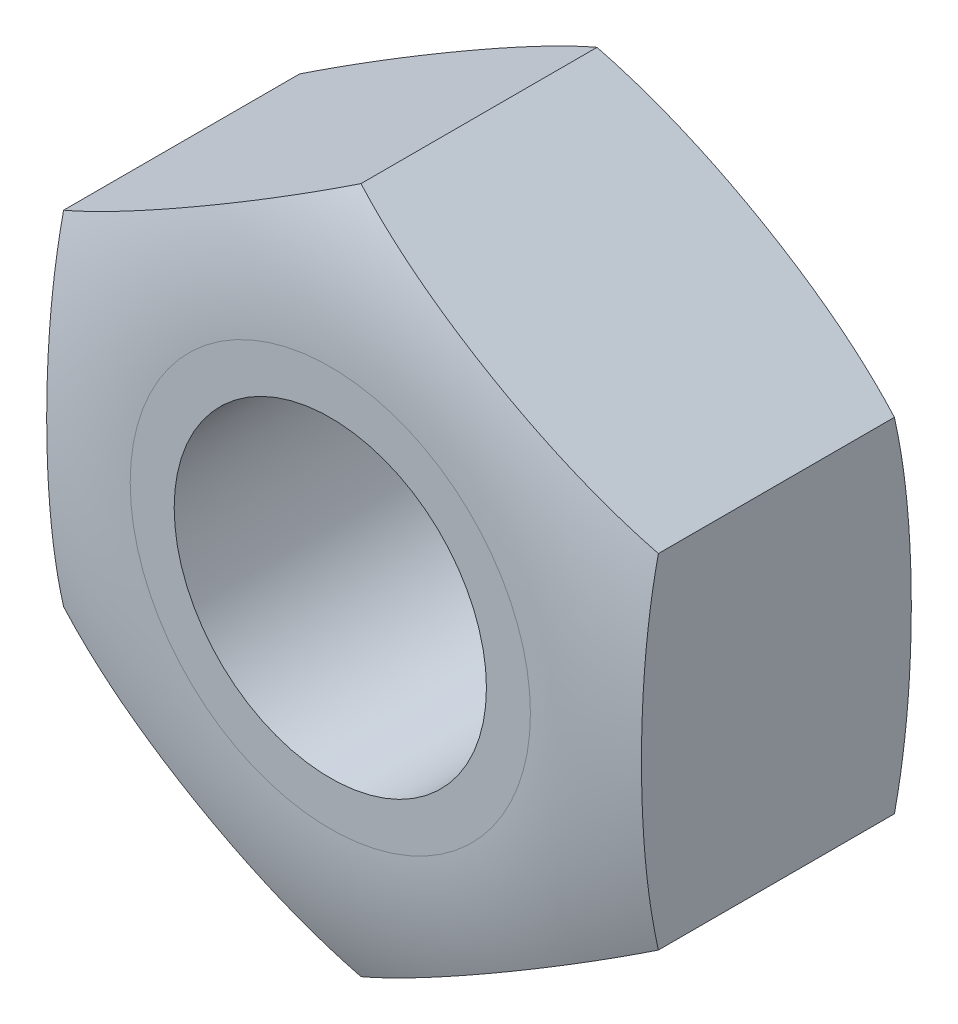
ISO-10303-21;
HEADER;
FILE_DESCRIPTION(('STEP AP214'),'2;1');
FILE_NAME('part.step','',(''),(''),'','','');
FILE_SCHEMA(('AUTOMOTIVE_DESIGN { 1 0 10303 214 1 1 1 1 }'));
ENDSEC;
DATA;
#1=APPLICATION_CONTEXT('core data for automotive mechanical design processes');
#2=APPLICATION_PROTOCOL_DEFINITION('international standard','automotive_design',2000,#1);
#3=PRODUCT_CONTEXT('',#1,'mechanical');
#4=PRODUCT('Part','Part','',(#3));
#5=PRODUCT_RELATED_PRODUCT_CATEGORY('part','',(#4));
#6=PRODUCT_DEFINITION_FORMATION('','',#4);
#7=PRODUCT_DEFINITION_CONTEXT('part definition',#1,'design');
#8=PRODUCT_DEFINITION('design','',#6,#7);
#9=PRODUCT_DEFINITION_SHAPE('','',#8);
#10=(LENGTH_UNIT() NAMED_UNIT(*) SI_UNIT(.MILLI.,.METRE.));
#11=(NAMED_UNIT(*) PLANE_ANGLE_UNIT() SI_UNIT($,.RADIAN.));
#12=(NAMED_UNIT(*) SI_UNIT($,.STERADIAN.) SOLID_ANGLE_UNIT());
#13=UNCERTAINTY_MEASURE_WITH_UNIT(LENGTH_MEASURE(1.E-05),#10,'distance_accuracy_value','');
#14=(GEOMETRIC_REPRESENTATION_CONTEXT(3) GLOBAL_UNCERTAINTY_ASSIGNED_CONTEXT((#13)) GLOBAL_UNIT_ASSIGNED_CONTEXT((#10,
#11,#12)) REPRESENTATION_CONTEXT('',''));
#15=CARTESIAN_POINT('',(0.,0.,0.));
#16=DIRECTION('',(0.,0.,1.));
#17=DIRECTION('',(1.,0.,0.));
#18=AXIS2_PLACEMENT_3D('',#15,#16,#17);
#19=CARTESIAN_POINT('',(0.,0.,0.));
#20=DIRECTION('',(0.,0.,1.));
#21=DIRECTION('',(1.,0.,0.));
#22=AXIS2_PLACEMENT_3D('',#19,#20,#21);
#23=PLANE('',#22);
#24=CARTESIAN_POINT('',(0.,0.,0.));
#25=DIRECTION('',(0.,0.,1.));
#26=DIRECTION('',(1.,0.,0.));
#27=AXIS2_PLACEMENT_3D('',#24,#25,#26);
#28=CIRCLE('',#27,2.1);
#29=CARTESIAN_POINT('',(2.1,0.,0.));
#30=VERTEX_POINT('',#29);
#31=EDGE_CURVE('E114',#30,#30,#28,.T.);
#32=ORIENTED_EDGE('',*,*,#31,.T.);
#33=EDGE_LOOP('',(#32));
#34=FACE_BOUND('',#33,.T.);
#35=CARTESIAN_POINT('',(0.,0.,0.));
#36=DIRECTION('',(0.,0.,-1.));
#37=DIRECTION('',(-1.,0.,0.));
#38=AXIS2_PLACEMENT_3D('',#35,#36,#37);
#39=CIRCLE('',#38,2.69154781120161);
#40=CARTESIAN_POINT('',(-2.69154781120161,0.,0.));
#41=VERTEX_POINT('',#40);
#42=EDGE_CURVE('E97',#41,#41,#39,.T.);
#43=ORIENTED_EDGE('',*,*,#42,.T.);
#44=EDGE_LOOP('',(#43));
#45=FACE_BOUND('',#44,.T.);
#46=ADVANCED_FACE('F37',(#34,#45),#23,.F.);
#47=CARTESIAN_POINT('',(0.,0.,4.));
#48=DIRECTION('',(0.,0.,1.));
#49=DIRECTION('',(1.,0.,0.));
#50=AXIS2_PLACEMENT_3D('',#47,#48,#49);
#51=PLANE('',#50);
#52=CARTESIAN_POINT('',(0.,0.,4.));
#53=DIRECTION('',(0.,0.,1.));
#54=DIRECTION('',(1.,0.,0.));
#55=AXIS2_PLACEMENT_3D('',#52,#53,#54);
#56=CIRCLE('',#55,2.1);
#57=CARTESIAN_POINT('',(2.1,0.,4.));
#58=VERTEX_POINT('',#57);
#59=EDGE_CURVE('E218',#58,#58,#56,.T.);
#60=ORIENTED_EDGE('',*,*,#59,.F.);
#61=EDGE_LOOP('',(#60));
#62=FACE_BOUND('',#61,.T.);
#63=CARTESIAN_POINT('',(0.,0.,4.));
#64=DIRECTION('',(0.,0.,-1.));
#65=DIRECTION('',(-1.,0.,0.));
#66=AXIS2_PLACEMENT_3D('',#63,#64,#65);
#67=CIRCLE('',#66,2.69154781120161);
#68=CARTESIAN_POINT('',(-2.69154781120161,0.,4.));
#69=VERTEX_POINT('',#68);
#70=EDGE_CURVE('E136',#69,#69,#67,.T.);
#71=ORIENTED_EDGE('',*,*,#70,.F.);
#72=EDGE_LOOP('',(#71));
#73=FACE_BOUND('',#72,.T.);
#74=ADVANCED_FACE('F230',(#62,#73),#51,.T.);
#75=CARTESIAN_POINT('',(4.,-2.3094010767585,4.));
#76=DIRECTION('',(-1.,0.,0.));
#77=DIRECTION('',(0.,0.,1.));
#78=AXIS2_PLACEMENT_3D('',#75,#76,#77);
#79=PLANE('',#78);
#80=DIRECTION('',(0.,0.,-1.));
#81=VECTOR('',#80,1.);
#82=CARTESIAN_POINT('',(4.,-2.3094010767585,4.));
#83=LINE('',#82,#81);
#84=CARTESIAN_POINT('',(4.00000000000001,-2.3094010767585,3.58736994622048));
#85=VERTEX_POINT('',#84);
#86=CARTESIAN_POINT('',(4.,-2.3094010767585,0.412630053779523));
#87=VERTEX_POINT('',#86);
#88=EDGE_CURVE('E110',#85,#87,#83,.T.);
#89=ORIENTED_EDGE('',*,*,#88,.T.);
#90=CARTESIAN_POINT('',(4.,0.,0.185514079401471));
#91=CARTESIAN_POINT('',(4.,0.118266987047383,0.185513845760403));
#92=CARTESIAN_POINT('',(4.,0.23653451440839,0.187024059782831));
#93=CARTESIAN_POINT('',(4.,0.472989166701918,0.193150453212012));
#94=CARTESIAN_POINT('',(4.,0.591176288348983,0.19776675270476));
#95=CARTESIAN_POINT('',(4.,0.945531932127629,0.216586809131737));
#96=CARTESIAN_POINT('',(4.,1.18147373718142,0.235761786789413));
#97=CARTESIAN_POINT('',(4.,1.65006477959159,0.290404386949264));
#98=CARTESIAN_POINT('',(4.,1.88272533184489,0.325771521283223));
#99=CARTESIAN_POINT('',(4.,2.34401473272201,0.416865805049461));
#100=CARTESIAN_POINT('',(4.,2.57264681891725,0.472575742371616));
#101=CARTESIAN_POINT('',(4.,2.93475780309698,0.581635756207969));
#102=CARTESIAN_POINT('',(4.,3.07052931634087,0.627411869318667));
#103=CARTESIAN_POINT('',(4.,3.33842487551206,0.728590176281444));
#104=CARTESIAN_POINT('',(4.,3.47054998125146,0.7839895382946));
#105=CARTESIAN_POINT('',(4.,3.73019648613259,0.904964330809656));
#106=CARTESIAN_POINT('',(4.,3.85771443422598,0.970547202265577));
#107=CARTESIAN_POINT('',(4.,4.10685113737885,1.11213593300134));
#108=CARTESIAN_POINT('',(4.,4.22846988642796,1.1881418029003));
#109=CARTESIAN_POINT('',(4.,4.4656268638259,1.35136413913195));
#110=CARTESIAN_POINT('',(4.,4.58109840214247,1.43867784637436));
#111=CARTESIAN_POINT('',(4.,4.80336898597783,1.6237201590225));
#112=CARTESIAN_POINT('',(4.,4.91016923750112,1.72144731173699));
#113=CARTESIAN_POINT('',(4.,5.1137445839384,1.92681019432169));
#114=CARTESIAN_POINT('',(4.,5.2105221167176,2.0344435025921));
#115=CARTESIAN_POINT('',(4.,5.39277719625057,2.25888526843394));
#116=CARTESIAN_POINT('',(4.,5.47825650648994,2.37569228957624));
#117=CARTESIAN_POINT('',(4.,5.62677422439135,2.60230781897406));
#118=CARTESIAN_POINT('',(4.,5.69128262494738,2.71115535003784));
#119=CARTESIAN_POINT('',(4.,5.81003111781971,2.93430959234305));
#120=CARTESIAN_POINT('',(4.,5.86427249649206,3.04861561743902));
#121=CARTESIAN_POINT('',(4.,5.96184697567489,3.28172846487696));
#122=CARTESIAN_POINT('',(4.,6.00518544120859,3.4005330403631));
#123=CARTESIAN_POINT('',(4.,6.08048174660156,3.64169528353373));
#124=CARTESIAN_POINT('',(4.,6.11244031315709,3.76405272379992));
#125=CARTESIAN_POINT('',(4.,6.16219954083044,3.99986613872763));
#126=CARTESIAN_POINT('',(4.,6.18103220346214,4.1131054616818));
#127=CARTESIAN_POINT('',(4.,6.20882761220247,4.34083071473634));
#128=CARTESIAN_POINT('',(4.,6.21778697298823,4.45531705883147));
#129=CARTESIAN_POINT('',(4.,6.2257275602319,4.68457701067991));
#130=CARTESIAN_POINT('',(4.,6.22471447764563,4.79935041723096));
#131=CARTESIAN_POINT('',(4.,6.21274645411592,5.02838941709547));
#132=CARTESIAN_POINT('',(4.,6.20178787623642,5.14265480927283));
#133=CARTESIAN_POINT('',(4.,6.15499154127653,5.47699551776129));
#134=CARTESIAN_POINT('',(4.,6.1054403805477,5.69531087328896));
#135=CARTESIAN_POINT('',(4.,5.97088830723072,6.12052429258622));
#136=CARTESIAN_POINT('',(4.,5.88589302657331,6.32742416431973));
#137=CARTESIAN_POINT('',(4.,5.68212908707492,6.72741845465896));
#138=CARTESIAN_POINT('',(4.,5.56291535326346,6.9202859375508));
#139=CARTESIAN_POINT('',(4.,5.29535963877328,7.28468579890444));
#140=CARTESIAN_POINT('',(4.,5.1469998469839,7.45620502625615));
#141=CARTESIAN_POINT('',(4.,4.81688395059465,7.78389044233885));
#142=CARTESIAN_POINT('',(4.,4.63370138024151,7.93861382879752));
#143=CARTESIAN_POINT('',(4.,4.24662477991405,8.21876923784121));
#144=CARTESIAN_POINT('',(4.,4.04275427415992,8.34423400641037));
#145=CARTESIAN_POINT('',(4.,3.67878341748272,8.53551769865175));
#146=CARTESIAN_POINT('',(4.,3.52222366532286,8.6082285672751));
#147=CARTESIAN_POINT('',(4.,3.20318475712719,8.7393823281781));
#148=CARTESIAN_POINT('',(4.,3.040703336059,8.797819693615));
#149=CARTESIAN_POINT('',(4.,2.71070970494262,8.90176756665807));
#150=CARTESIAN_POINT('',(4.,2.54317439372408,8.94720374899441));
#151=CARTESIAN_POINT('',(4.,2.20538126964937,9.02617120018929));
#152=CARTESIAN_POINT('',(4.,2.03512375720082,9.0597037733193));
#153=CARTESIAN_POINT('',(4.,1.70259026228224,9.11489808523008));
#154=CARTESIAN_POINT('',(4.,1.54040550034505,9.13712252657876));
#155=CARTESIAN_POINT('',(4.,1.21515186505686,9.17377370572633));
#156=CARTESIAN_POINT('',(4.,1.05208286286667,9.18819927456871));
#157=CARTESIAN_POINT('',(4.,0.725230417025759,9.21039125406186));
#158=CARTESIAN_POINT('',(4.,0.56144623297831,9.21814642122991));
#159=CARTESIAN_POINT('',(4.,0.23372261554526,9.22768090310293));
#160=CARTESIAN_POINT('',(4.,0.0697831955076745,9.22946069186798));
#161=CARTESIAN_POINT('',(4.,-0.257794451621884,9.22722805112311));
#162=CARTESIAN_POINT('',(4.,-0.421432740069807,9.22322490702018));
#163=CARTESIAN_POINT('',(4.,-0.748463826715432,9.2090454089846));
#164=CARTESIAN_POINT('',(4.,-0.911856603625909,9.1988685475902));
#165=CARTESIAN_POINT('',(4.,-1.23776596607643,9.17147114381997));
#166=CARTESIAN_POINT('',(4.,-1.4002836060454,9.15426347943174));
#167=CARTESIAN_POINT('',(4.,-1.72422407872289,9.11158426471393));
#168=CARTESIAN_POINT('',(4.,-1.88564711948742,9.08611433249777));
#169=CARTESIAN_POINT('',(4.,-2.19431596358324,9.02788195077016));
#170=CARTESIAN_POINT('',(4.,-2.34169487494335,8.99583356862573));
#171=CARTESIAN_POINT('',(4.,-2.63416847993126,8.92248338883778));
#172=CARTESIAN_POINT('',(4.,-2.77926303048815,8.88118101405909));
#173=CARTESIAN_POINT('',(4.,-3.0658047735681,8.7885200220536));
#174=CARTESIAN_POINT('',(4.,-3.20726066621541,8.73718853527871));
#175=CARTESIAN_POINT('',(4.,-3.48574679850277,8.62368505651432));
#176=CARTESIAN_POINT('',(4.,-3.62277800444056,8.56151545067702));
#177=CARTESIAN_POINT('',(4.,-3.89281899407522,8.42499743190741));
#178=CARTESIAN_POINT('',(4.,-4.0257571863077,8.35050662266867));
#179=CARTESIAN_POINT('',(4.,-4.2843141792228,8.1896983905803));
#180=CARTESIAN_POINT('',(4.,-4.40993275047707,8.10338059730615));
#181=CARTESIAN_POINT('',(4.,-4.65240042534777,7.91894438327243));
#182=CARTESIAN_POINT('',(4.,-4.76924120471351,7.82081498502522));
#183=CARTESIAN_POINT('',(4.,-4.9924275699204,7.61326223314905));
#184=CARTESIAN_POINT('',(4.,-5.09877476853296,7.50384062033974));
#185=CARTESIAN_POINT('',(4.,-5.28787698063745,7.28768224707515));
#186=CARTESIAN_POINT('',(4.,-5.37193853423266,7.182086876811));
#187=CARTESIAN_POINT('',(4.,-5.52963439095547,6.96338104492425));
#188=CARTESIAN_POINT('',(4.,-5.60327011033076,6.85027160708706));
#189=CARTESIAN_POINT('',(4.,-5.73913908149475,6.61753586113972));
#190=CARTESIAN_POINT('',(4.,-5.80138289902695,6.49791572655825));
#191=CARTESIAN_POINT('',(4.,-5.91374797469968,6.25311337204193));
#192=CARTESIAN_POINT('',(4.,-5.96387065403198,6.1279318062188));
#193=CARTESIAN_POINT('',(4.,-6.04574070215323,5.88949185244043));
#194=CARTESIAN_POINT('',(4.,-6.07901835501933,5.7767562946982));
#195=CARTESIAN_POINT('',(4.,-6.13553249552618,5.54874863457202));
#196=CARTESIAN_POINT('',(4.,-6.15876563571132,5.4334757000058));
#197=CARTESIAN_POINT('',(4.,-6.19491996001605,5.20139987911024));
#198=CARTESIAN_POINT('',(4.,-6.20784773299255,5.08459801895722));
#199=CARTESIAN_POINT('',(4.,-6.22328497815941,4.85026304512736));
#200=CARTESIAN_POINT('',(4.,-6.22579069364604,4.73272968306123));
#201=CARTESIAN_POINT('',(4.,-6.22047498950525,4.50339872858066));
#202=CARTESIAN_POINT('',(4.,-6.21313075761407,4.39158979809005));
#203=CARTESIAN_POINT('',(4.,-6.1890099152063,4.16895523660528));
#204=CARTESIAN_POINT('',(4.,-6.17222998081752,4.05812996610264));
#205=CARTESIAN_POINT('',(4.,-6.12939874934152,3.83833765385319));
#206=CARTESIAN_POINT('',(4.,-6.1033520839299,3.72936971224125));
#207=CARTESIAN_POINT('',(4.,-6.0422387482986,3.51398074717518));
#208=CARTESIAN_POINT('',(4.,-6.00716873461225,3.40756068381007));
#209=CARTESIAN_POINT('',(4.,-5.88884614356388,3.09319106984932));
#210=CARTESIAN_POINT('',(4.,-5.79245889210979,2.89001986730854));
#211=CARTESIAN_POINT('',(4.,-5.56824614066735,2.5020261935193));
#212=CARTESIAN_POINT('',(4.,-5.44041676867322,2.31720598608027));
#213=CARTESIAN_POINT('',(4.,-5.15187438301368,1.96258724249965));
#214=CARTESIAN_POINT('',(4.,-4.9900321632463,1.79370971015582));
#215=CARTESIAN_POINT('',(4.,-4.64242482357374,1.48271130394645));
#216=CARTESIAN_POINT('',(4.,-4.45665373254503,1.34059713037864));
#217=CARTESIAN_POINT('',(4.,-4.15506446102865,1.14214145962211));
#218=CARTESIAN_POINT('',(4.,-4.04550833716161,1.07603342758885));
#219=CARTESIAN_POINT('',(4.,-3.82181154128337,0.9520761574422));
#220=CARTESIAN_POINT('',(4.,-3.70767056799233,0.894227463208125));
#221=CARTESIAN_POINT('',(4.,-3.3597575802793,0.732879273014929));
#222=CARTESIAN_POINT('',(4.,-3.12031126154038,0.64145884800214));
#223=CARTESIAN_POINT('',(4.,-2.645800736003,0.491941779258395));
#224=CARTESIAN_POINT('',(4.,-2.41120130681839,0.432308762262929));
#225=CARTESIAN_POINT('',(4.,-1.93735071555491,0.334872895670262));
#226=CARTESIAN_POINT('',(4.,-1.69809486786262,0.297093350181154));
#227=CARTESIAN_POINT('',(4.,-1.33696330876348,0.253474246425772));
#228=CARTESIAN_POINT('',(4.,-1.21580653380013,0.241090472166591));
#229=CARTESIAN_POINT('',(4.,-0.973153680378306,0.22026710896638));
#230=CARTESIAN_POINT('',(4.,-0.851657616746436,0.211827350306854));
#231=CARTESIAN_POINT('',(4.,-0.608511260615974,0.198497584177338));
#232=CARTESIAN_POINT('',(4.,-0.48686102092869,0.193606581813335));
#233=CARTESIAN_POINT('',(4.,-0.243474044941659,0.187114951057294));
#234=CARTESIAN_POINT('',(4.,-0.121737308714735,0.185514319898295));
#235=CARTESIAN_POINT('',(4.,0.,0.185514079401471));
#236=B_SPLINE_CURVE_WITH_KNOTS('',3,(#90,#91,#92,#93,#94,#95,#96,#97,#98,#99,#100,#101,#102,
#103,#104,#105,#106,#107,#108,#109,#110,#111,#112,#113,#114,#115,#116,#117,#118,#119,#120,#121,
#122,#123,#124,#125,#126,#127,#128,#129,#130,#131,#132,#133,#134,#135,#136,#137,#138,#139,#140,
#141,#142,#143,#144,#145,#146,#147,#148,#149,#150,#151,#152,#153,#154,#155,#156,#157,#158,#159,
#160,#161,#162,#163,#164,#165,#166,#167,#168,#169,#170,#171,#172,#173,#174,#175,#176,#177,#178,
#179,#180,#181,#182,#183,#184,#185,#186,#187,#188,#189,#190,#191,#192,#193,#194,#195,#196,#197,
#198,#199,#200,#201,#202,#203,#204,#205,#206,#207,#208,#209,#210,#211,#212,#213,#214,#215,#216,
#217,#218,#219,#220,#221,#222,#223,#224,#225,#226,#227,#228,#229,#230,#231,#232,#233,#234,#235),
.UNSPECIFIED.,.T.,.F.,(4,2,2,2,2,2,2,2,2,2,2,2,2,2,2,2,2,2,2,2,2,2,2,2,2,2,2,2,2,2,2,2,2,2,2,2,
2,2,2,2,2,2,2,2,2,2,2,2,2,2,2,2,2,2,2,2,2,2,2,2,2,2,2,2,2,2,2,2,2,2,2,2,4),(0.,
0.354789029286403,0.709591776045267,1.41926017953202,2.12458287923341,2.82931018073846,
3.25883690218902,3.68823744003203,4.11795322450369,4.54766944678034,4.98136256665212,
5.41499526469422,5.84852223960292,6.28198146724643,6.66105028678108,7.0400715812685,
7.41890600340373,7.79771622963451,8.14167721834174,8.48575610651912,8.8296386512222,
9.17364699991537,9.84183031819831,10.5099075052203,11.1871019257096,11.8647114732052,
12.5811466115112,13.2967760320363,13.8139471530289,14.3313182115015,14.8515904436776,
15.3718056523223,15.8626901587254,16.3536482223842,16.8454322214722,17.3371772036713,
17.8281334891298,18.3191301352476,18.809231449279,19.2992368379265,19.751444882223,
20.2036811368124,20.6547105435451,21.1056407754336,21.562202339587,22.0187782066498,
22.4757817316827,22.9327149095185,23.3370388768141,23.7413078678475,24.1451999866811,
24.5490447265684,24.9012370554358,25.2535466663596,25.6056308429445,25.957841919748,
26.2935916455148,26.6294597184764,26.9651601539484,27.3009851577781,27.9722962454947,
28.6436900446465,29.3424869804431,30.0414586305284,30.4250166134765,30.8085998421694,
31.5751147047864,32.3001242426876,33.0259054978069,33.3912236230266,33.7565260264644,
34.1217259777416,34.4869256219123),.UNSPECIFIED.);
#237=CARTESIAN_POINT('',(4.00000000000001,2.3094010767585,0.412630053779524));
#238=VERTEX_POINT('',#237);
#239=EDGE_CURVE('E53',#87,#238,#236,.T.);
#240=ORIENTED_EDGE('',*,*,#239,.T.);
#241=DIRECTION('',(0.,0.,-1.));
#242=VECTOR('',#241,1.);
#243=CARTESIAN_POINT('',(4.,2.3094010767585,4.));
#244=LINE('',#243,#242);
#245=CARTESIAN_POINT('',(4.,2.3094010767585,3.58736994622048));
#246=VERTEX_POINT('',#245);
#247=EDGE_CURVE('E11',#246,#238,#244,.T.);
#248=ORIENTED_EDGE('',*,*,#247,.F.);
#249=CARTESIAN_POINT('',(4.,0.,3.81448592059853));
#250=CARTESIAN_POINT('',(4.,-0.118266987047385,3.8144861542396));
#251=CARTESIAN_POINT('',(4.,-0.236534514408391,3.81297594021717));
#252=CARTESIAN_POINT('',(4.,-0.472989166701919,3.80684954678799));
#253=CARTESIAN_POINT('',(4.,-0.591176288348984,3.80223324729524));
#254=CARTESIAN_POINT('',(4.,-0.945531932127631,3.78341319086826));
#255=CARTESIAN_POINT('',(4.,-1.18147373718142,3.76423821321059));
#256=CARTESIAN_POINT('',(4.,-1.65006477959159,3.70959561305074));
#257=CARTESIAN_POINT('',(4.,-1.88272533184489,3.67422847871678));
#258=CARTESIAN_POINT('',(4.,-2.34401473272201,3.58313419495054));
#259=CARTESIAN_POINT('',(4.,-2.57264681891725,3.52742425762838));
#260=CARTESIAN_POINT('',(4.,-2.93475780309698,3.41836424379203));
#261=CARTESIAN_POINT('',(4.,-3.07052931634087,3.37258813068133));
#262=CARTESIAN_POINT('',(4.,-3.33842487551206,3.27140982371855));
#263=CARTESIAN_POINT('',(4.,-3.47054998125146,3.2160104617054));
#264=CARTESIAN_POINT('',(4.,-3.73019648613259,3.09503566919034));
#265=CARTESIAN_POINT('',(4.,-3.85771443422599,3.02945279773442));
#266=CARTESIAN_POINT('',(4.,-4.10685113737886,2.88786406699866));
#267=CARTESIAN_POINT('',(4.,-4.22846988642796,2.8118581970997));
#268=CARTESIAN_POINT('',(4.,-4.4656268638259,2.64863586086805));
#269=CARTESIAN_POINT('',(4.,-4.58109840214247,2.56132215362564));
#270=CARTESIAN_POINT('',(4.,-4.80336898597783,2.3762798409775));
#271=CARTESIAN_POINT('',(4.,-4.91016923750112,2.27855268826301));
#272=CARTESIAN_POINT('',(4.,-5.1137445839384,2.07318980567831));
#273=CARTESIAN_POINT('',(4.,-5.2105221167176,1.9655564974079));
#274=CARTESIAN_POINT('',(4.,-5.39277719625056,1.74111473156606));
#275=CARTESIAN_POINT('',(4.,-5.47825650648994,1.62430771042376));
#276=CARTESIAN_POINT('',(4.,-5.62677422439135,1.39769218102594));
#277=CARTESIAN_POINT('',(4.,-5.69128262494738,1.28884464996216));
#278=CARTESIAN_POINT('',(4.,-5.81003111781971,1.06569040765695));
#279=CARTESIAN_POINT('',(4.,-5.86427249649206,0.951384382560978));
#280=CARTESIAN_POINT('',(4.,-5.96184697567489,0.718271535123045));
#281=CARTESIAN_POINT('',(4.,-6.00518544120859,0.5994669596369));
#282=CARTESIAN_POINT('',(4.,-6.08048174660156,0.358304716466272));
#283=CARTESIAN_POINT('',(4.,-6.11244031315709,0.235947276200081));
#284=CARTESIAN_POINT('',(4.,-6.16219954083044,0.000133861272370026));
#285=CARTESIAN_POINT('',(4.,-6.18103220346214,-0.113105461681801));
#286=CARTESIAN_POINT('',(4.,-6.20882761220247,-0.340830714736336));
#287=CARTESIAN_POINT('',(4.,-6.21778697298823,-0.455317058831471));
#288=CARTESIAN_POINT('',(4.,-6.2257275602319,-0.684577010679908));
#289=CARTESIAN_POINT('',(4.,-6.22471447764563,-0.799350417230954));
#290=CARTESIAN_POINT('',(4.,-6.21274645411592,-1.02838941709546));
#291=CARTESIAN_POINT('',(4.,-6.20178787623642,-1.14265480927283));
#292=CARTESIAN_POINT('',(4.,-6.15499154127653,-1.47699551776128));
#293=CARTESIAN_POINT('',(4.,-6.1054403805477,-1.69531087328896));
#294=CARTESIAN_POINT('',(4.,-5.97088830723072,-2.12052429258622));
#295=CARTESIAN_POINT('',(4.,-5.88589302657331,-2.32742416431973));
#296=CARTESIAN_POINT('',(4.,-5.68212908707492,-2.72741845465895));
#297=CARTESIAN_POINT('',(4.,-5.56291535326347,-2.9202859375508));
#298=CARTESIAN_POINT('',(4.,-5.29535963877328,-3.28468579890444));
#299=CARTESIAN_POINT('',(4.,-5.1469998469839,-3.45620502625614));
#300=CARTESIAN_POINT('',(4.,-4.81688395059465,-3.78389044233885));
#301=CARTESIAN_POINT('',(4.,-4.63370138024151,-3.93861382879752));
#302=CARTESIAN_POINT('',(4.,-4.24662477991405,-4.2187692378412));
#303=CARTESIAN_POINT('',(4.,-4.04275427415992,-4.34423400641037));
#304=CARTESIAN_POINT('',(4.,-3.67878341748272,-4.53551769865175));
#305=CARTESIAN_POINT('',(4.,-3.52222366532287,-4.6082285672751));
#306=CARTESIAN_POINT('',(4.,-3.20318475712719,-4.7393823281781));
#307=CARTESIAN_POINT('',(4.,-3.040703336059,-4.797819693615));
#308=CARTESIAN_POINT('',(4.,-2.71070970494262,-4.90176756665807));
#309=CARTESIAN_POINT('',(4.,-2.54317439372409,-4.94720374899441));
#310=CARTESIAN_POINT('',(4.,-2.20538126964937,-5.02617120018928));
#311=CARTESIAN_POINT('',(4.,-2.03512375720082,-5.0597037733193));
#312=CARTESIAN_POINT('',(4.,-1.70259026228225,-5.11489808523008));
#313=CARTESIAN_POINT('',(4.,-1.54040550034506,-5.13712252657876));
#314=CARTESIAN_POINT('',(4.,-1.21515186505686,-5.17377370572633));
#315=CARTESIAN_POINT('',(4.,-1.05208286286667,-5.18819927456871));
#316=CARTESIAN_POINT('',(4.,-0.725230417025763,-5.21039125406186));
#317=CARTESIAN_POINT('',(4.,-0.561446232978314,-5.21814642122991));
#318=CARTESIAN_POINT('',(4.,-0.233722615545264,-5.22768090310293));
#319=CARTESIAN_POINT('',(4.,-0.0697831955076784,-5.22946069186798));
#320=CARTESIAN_POINT('',(4.,0.257794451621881,-5.22722805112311));
#321=CARTESIAN_POINT('',(4.,0.421432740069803,-5.22322490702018));
#322=CARTESIAN_POINT('',(4.,0.748463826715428,-5.2090454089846));
#323=CARTESIAN_POINT('',(4.,0.911856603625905,-5.1988685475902));
#324=CARTESIAN_POINT('',(4.,1.23776596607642,-5.17147114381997));
#325=CARTESIAN_POINT('',(4.,1.4002836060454,-5.15426347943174));
#326=CARTESIAN_POINT('',(4.,1.72422407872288,-5.11158426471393));
#327=CARTESIAN_POINT('',(4.,1.88564711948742,-5.08611433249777));
#328=CARTESIAN_POINT('',(4.,2.19431596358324,-5.02788195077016));
#329=CARTESIAN_POINT('',(4.,2.34169487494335,-4.99583356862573));
#330=CARTESIAN_POINT('',(4.,2.63416847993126,-4.92248338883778));
#331=CARTESIAN_POINT('',(4.,2.77926303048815,-4.88118101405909));
#332=CARTESIAN_POINT('',(4.,3.06580477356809,-4.7885200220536));
#333=CARTESIAN_POINT('',(4.,3.20726066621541,-4.73718853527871));
#334=CARTESIAN_POINT('',(4.,3.48574679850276,-4.62368505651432));
#335=CARTESIAN_POINT('',(4.,3.62277800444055,-4.56151545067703));
#336=CARTESIAN_POINT('',(4.,3.89281899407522,-4.42499743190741));
#337=CARTESIAN_POINT('',(4.,4.0257571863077,-4.35050662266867));
#338=CARTESIAN_POINT('',(4.,4.28431417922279,-4.18969839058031));
#339=CARTESIAN_POINT('',(4.,4.40993275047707,-4.10338059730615));
#340=CARTESIAN_POINT('',(4.,4.65240042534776,-3.91894438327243));
#341=CARTESIAN_POINT('',(4.,4.76924120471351,-3.82081498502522));
#342=CARTESIAN_POINT('',(4.,4.9924275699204,-3.61326223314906));
#343=CARTESIAN_POINT('',(4.,5.09877476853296,-3.50384062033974));
#344=CARTESIAN_POINT('',(4.,5.28787698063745,-3.28768224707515));
#345=CARTESIAN_POINT('',(4.,5.37193853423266,-3.182086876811));
#346=CARTESIAN_POINT('',(4.,5.52963439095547,-2.96338104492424));
#347=CARTESIAN_POINT('',(4.,5.60327011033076,-2.85027160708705));
#348=CARTESIAN_POINT('',(4.,5.73913908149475,-2.61753586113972));
#349=CARTESIAN_POINT('',(4.,5.80138289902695,-2.49791572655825));
#350=CARTESIAN_POINT('',(4.,5.91374797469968,-2.25311337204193));
#351=CARTESIAN_POINT('',(4.,5.96387065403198,-2.12793180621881));
#352=CARTESIAN_POINT('',(4.,6.04574070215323,-1.88949185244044));
#353=CARTESIAN_POINT('',(4.,6.07901835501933,-1.7767562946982));
#354=CARTESIAN_POINT('',(4.,6.13553249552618,-1.54874863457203));
#355=CARTESIAN_POINT('',(4.,6.15876563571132,-1.4334757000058));
#356=CARTESIAN_POINT('',(4.,6.19491996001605,-1.20139987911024));
#357=CARTESIAN_POINT('',(4.,6.20784773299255,-1.08459801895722));
#358=CARTESIAN_POINT('',(4.,6.22328497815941,-0.850263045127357));
#359=CARTESIAN_POINT('',(4.,6.22579069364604,-0.732729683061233));
#360=CARTESIAN_POINT('',(4.,6.22047498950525,-0.503398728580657));
#361=CARTESIAN_POINT('',(4.,6.21313075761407,-0.391589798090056));
#362=CARTESIAN_POINT('',(4.,6.1890099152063,-0.168955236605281));
#363=CARTESIAN_POINT('',(4.,6.17222998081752,-0.0581299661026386));
#364=CARTESIAN_POINT('',(4.,6.12939874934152,0.161662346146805));
#365=CARTESIAN_POINT('',(4.,6.1033520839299,0.270630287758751));
#366=CARTESIAN_POINT('',(4.,6.0422387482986,0.48601925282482));
#367=CARTESIAN_POINT('',(4.,6.00716873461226,0.592439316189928));
#368=CARTESIAN_POINT('',(4.,5.88884614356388,0.906808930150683));
#369=CARTESIAN_POINT('',(4.,5.79245889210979,1.10998013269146));
#370=CARTESIAN_POINT('',(4.,5.56824614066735,1.4979738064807));
#371=CARTESIAN_POINT('',(4.,5.44041676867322,1.68279401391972));
#372=CARTESIAN_POINT('',(4.,5.15187438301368,2.03741275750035));
#373=CARTESIAN_POINT('',(4.,4.9900321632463,2.20629028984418));
#374=CARTESIAN_POINT('',(4.,4.64242482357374,2.51728869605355));
#375=CARTESIAN_POINT('',(4.,4.45665373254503,2.65940286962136));
#376=CARTESIAN_POINT('',(4.,4.15506446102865,2.85785854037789));
#377=CARTESIAN_POINT('',(4.,4.04550833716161,2.92396657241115));
#378=CARTESIAN_POINT('',(4.,3.82181154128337,3.0479238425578));
#379=CARTESIAN_POINT('',(4.,3.70767056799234,3.10577253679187));
#380=CARTESIAN_POINT('',(4.,3.35975758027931,3.26712072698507));
#381=CARTESIAN_POINT('',(4.,3.12031126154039,3.35854115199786));
#382=CARTESIAN_POINT('',(4.,2.645800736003,3.5080582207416));
#383=CARTESIAN_POINT('',(4.,2.41120130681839,3.56769123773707));
#384=CARTESIAN_POINT('',(4.,1.93735071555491,3.66512710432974));
#385=CARTESIAN_POINT('',(4.,1.69809486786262,3.70290664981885));
#386=CARTESIAN_POINT('',(4.,1.33696330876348,3.74652575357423));
#387=CARTESIAN_POINT('',(4.,1.21580653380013,3.75890952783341));
#388=CARTESIAN_POINT('',(4.,0.973153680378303,3.77973289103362));
#389=CARTESIAN_POINT('',(4.,0.851657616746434,3.78817264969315));
#390=CARTESIAN_POINT('',(4.,0.608511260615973,3.80150241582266));
#391=CARTESIAN_POINT('',(4.,0.486861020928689,3.80639341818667));
#392=CARTESIAN_POINT('',(4.,0.243474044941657,3.81288504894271));
#393=CARTESIAN_POINT('',(4.,0.121737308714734,3.81448568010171));
#394=CARTESIAN_POINT('',(4.,0.,3.81448592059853));
#395=B_SPLINE_CURVE_WITH_KNOTS('',3,(#249,#250,#251,#252,#253,#254,#255,#256,#257,#258,#259,
#260,#261,#262,#263,#264,#265,#266,#267,#268,#269,#270,#271,#272,#273,#274,#275,#276,#277,#278,
#279,#280,#281,#282,#283,#284,#285,#286,#287,#288,#289,#290,#291,#292,#293,#294,#295,#296,#297,
#298,#299,#300,#301,#302,#303,#304,#305,#306,#307,#308,#309,#310,#311,#312,#313,#314,#315,#316,
#317,#318,#319,#320,#321,#322,#323,#324,#325,#326,#327,#328,#329,#330,#331,#332,#333,#334,#335,
#336,#337,#338,#339,#340,#341,#342,#343,#344,#345,#346,#347,#348,#349,#350,#351,#352,#353,#354,
#355,#356,#357,#358,#359,#360,#361,#362,#363,#364,#365,#366,#367,#368,#369,#370,#371,#372,#373,
#374,#375,#376,#377,#378,#379,#380,#381,#382,#383,#384,#385,#386,#387,#388,#389,#390,#391,#392,
#393,#394),.UNSPECIFIED.,.T.,.F.,(4,2,2,2,2,2,2,2,2,2,2,2,2,2,2,2,2,2,2,2,2,2,2,2,2,2,2,2,2,2,2,
2,2,2,2,2,2,2,2,2,2,2,2,2,2,2,2,2,2,2,2,2,2,2,2,2,2,2,2,2,2,2,2,2,2,2,2,2,2,2,2,2,4),(0.,
0.354789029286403,0.709591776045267,1.41926017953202,2.12458287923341,2.82931018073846,
3.25883690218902,3.68823744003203,4.11795322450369,4.54766944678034,4.98136256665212,
5.41499526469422,5.84852223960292,6.28198146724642,6.66105028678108,7.04007158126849,
7.41890600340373,7.7977162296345,8.14167721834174,8.48575610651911,8.8296386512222,
9.17364699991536,9.8418303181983,10.5099075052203,11.1871019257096,11.8647114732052,
12.5811466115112,13.2967760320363,13.8139471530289,14.3313182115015,14.8515904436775,
15.3718056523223,15.8626901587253,16.3536482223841,16.8454322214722,17.3371772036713,
17.8281334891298,18.3191301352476,18.809231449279,19.2992368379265,19.751444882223,
20.2036811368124,20.6547105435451,21.1056407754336,21.562202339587,22.0187782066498,
22.4757817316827,22.9327149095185,23.3370388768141,23.7413078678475,24.1451999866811,
24.5490447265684,24.9012370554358,25.2535466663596,25.6056308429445,25.957841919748,
26.2935916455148,26.6294597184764,26.9651601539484,27.3009851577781,27.9722962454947,
28.6436900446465,29.3424869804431,30.0414586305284,30.4250166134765,30.8085998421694,
31.5751147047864,32.3001242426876,33.0259054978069,33.3912236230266,33.7565260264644,
34.1217259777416,34.4869256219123),.UNSPECIFIED.);
#396=EDGE_CURVE('E212',#246,#85,#395,.T.);
#397=ORIENTED_EDGE('',*,*,#396,.T.);
#398=EDGE_LOOP('',(#89,#240,#248,#397));
#399=FACE_BOUND('',#398,.T.);
#400=ADVANCED_FACE('F39',(#399),#79,.F.);
#401=CARTESIAN_POINT('',(4.,2.3094010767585,4.));
#402=DIRECTION('',(-0.5,-0.866025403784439,0.));
#403=DIRECTION('',(0.866025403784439,-0.5,0.));
#404=AXIS2_PLACEMENT_3D('',#401,#402,#403);
#405=PLANE('',#404);
#406=ORIENTED_EDGE('',*,*,#247,.T.);
#407=CARTESIAN_POINT('',(4.0002,2.30928560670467,0.412681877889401));
#408=CARTESIAN_POINT('',(3.87273272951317,2.3828788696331,0.379660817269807));
#409=CARTESIAN_POINT('',(3.74446723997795,2.456932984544,0.351054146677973));
#410=CARTESIAN_POINT('',(3.48690712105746,2.60563538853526,0.30163106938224));
#411=CARTESIAN_POINT('',(3.35761334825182,2.68028318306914,0.280808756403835));
#412=CARTESIAN_POINT('',(3.09831906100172,2.82998680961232,0.245862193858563));
#413=CARTESIAN_POINT('',(2.96831829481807,2.90504278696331,0.231740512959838));
#414=CARTESIAN_POINT('',(2.70791985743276,3.05538389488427,0.209298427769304));
#415=CARTESIAN_POINT('',(2.57752210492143,3.13066907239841,0.200979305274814));
#416=CARTESIAN_POINT('',(2.31868117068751,3.28011095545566,0.189603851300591));
#417=CARTESIAN_POINT('',(2.19024064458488,3.35426612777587,0.18646423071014));
#418=CARTESIAN_POINT('',(1.93334145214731,3.50258694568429,0.184932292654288));
#419=CARTESIAN_POINT('',(1.80488278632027,3.57675259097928,0.186539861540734));
#420=CARTESIAN_POINT('',(1.54811516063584,3.72499744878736,0.194633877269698));
#421=CARTESIAN_POINT('',(1.41980616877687,3.79907667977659,0.201118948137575));
#422=CARTESIAN_POINT('',(1.16348533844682,3.94706358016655,0.219464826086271));
#423=CARTESIAN_POINT('',(1.03547345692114,4.02097127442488,0.231324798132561));
#424=CARTESIAN_POINT('',(0.831642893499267,4.13865290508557,0.25516756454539));
#425=CARTESIAN_POINT('',(0.755648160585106,4.18252848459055,0.265161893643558));
#426=CARTESIAN_POINT('',(0.603942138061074,4.27011599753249,0.28753604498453));
#427=CARTESIAN_POINT('',(0.52823077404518,4.31382797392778,0.299915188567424));
#428=CARTESIAN_POINT('',(0.376802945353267,4.40125487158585,0.327335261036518));
#429=CARTESIAN_POINT('',(0.301088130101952,4.44496884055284,0.342388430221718));
#430=CARTESIAN_POINT('',(0.150085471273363,4.53215026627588,0.375343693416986));
#431=CARTESIAN_POINT('',(0.0747978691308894,4.57561758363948,0.393247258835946));
#432=CARTESIAN_POINT('',(-0.000199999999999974,4.61891762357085,0.412681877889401));
#433=B_SPLINE_CURVE_WITH_KNOTS('',3,(#407,#408,#409,#410,#411,#412,#413,#414,#415,#416,#417,
#418,#419,#420,#421,#422,#423,#424,#425,#426,#427,#428,#429,#430,#431,#432),.UNSPECIFIED.,.F.,
.F.,(4,2,2,2,2,2,2,2,2,2,2,2,4),(0.,0.452371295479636,0.904398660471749,1.3565991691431,
1.80889953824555,2.25385314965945,2.69879610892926,3.14361359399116,3.5883619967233,
3.85328968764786,4.11814209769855,4.3842396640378,4.65047504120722),.UNSPECIFIED.);
#434=CARTESIAN_POINT('',(0.,4.61880215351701,0.412630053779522));
#435=VERTEX_POINT('',#434);
#436=EDGE_CURVE('E134',#238,#435,#433,.T.);
#437=ORIENTED_EDGE('',*,*,#436,.T.);
#438=DIRECTION('',(0.,0.,-1.));
#439=VECTOR('',#438,1.);
#440=CARTESIAN_POINT('',(0.,4.61880215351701,4.));
#441=LINE('',#440,#439);
#442=CARTESIAN_POINT('',(0.,4.61880215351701,3.58736994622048));
#443=VERTEX_POINT('',#442);
#444=EDGE_CURVE('E46',#443,#435,#441,.T.);
#445=ORIENTED_EDGE('',*,*,#444,.F.);
#446=CARTESIAN_POINT('',(-0.000199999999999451,4.61891762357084,3.5873181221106));
#447=CARTESIAN_POINT('',(0.127267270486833,4.54532436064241,3.62033918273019));
#448=CARTESIAN_POINT('',(0.255532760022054,4.47127024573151,3.64894585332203));
#449=CARTESIAN_POINT('',(0.513092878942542,4.32256784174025,3.69836893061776));
#450=CARTESIAN_POINT('',(0.642386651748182,4.24792004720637,3.71919124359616));
#451=CARTESIAN_POINT('',(0.901680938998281,4.0982164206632,3.75413780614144));
#452=CARTESIAN_POINT('',(1.03168170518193,4.0231604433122,3.76825948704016));
#453=CARTESIAN_POINT('',(1.29208014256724,3.87281933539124,3.7907015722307));
#454=CARTESIAN_POINT('',(1.42247789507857,3.7975341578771,3.79902069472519));
#455=CARTESIAN_POINT('',(1.68131882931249,3.64809227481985,3.81039614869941));
#456=CARTESIAN_POINT('',(1.80975935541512,3.57393710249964,3.81353576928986));
#457=CARTESIAN_POINT('',(2.06665854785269,3.42561628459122,3.81506770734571));
#458=CARTESIAN_POINT('',(2.19511721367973,3.35145063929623,3.81346013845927));
#459=CARTESIAN_POINT('',(2.45188483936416,3.20320578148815,3.8053661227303));
#460=CARTESIAN_POINT('',(2.58019383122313,3.12912655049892,3.79888105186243));
#461=CARTESIAN_POINT('',(2.83651466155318,2.98113965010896,3.78053517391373));
#462=CARTESIAN_POINT('',(2.96452654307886,2.90723195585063,3.76867520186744));
#463=CARTESIAN_POINT('',(3.16835710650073,2.78955032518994,3.74483243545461));
#464=CARTESIAN_POINT('',(3.24435183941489,2.74567474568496,3.73483810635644));
#465=CARTESIAN_POINT('',(3.39605786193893,2.65808723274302,3.71246395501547));
#466=CARTESIAN_POINT('',(3.47176922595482,2.61437525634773,3.70008481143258));
#467=CARTESIAN_POINT('',(3.62319705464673,2.52694835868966,3.67266473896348));
#468=CARTESIAN_POINT('',(3.69891186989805,2.48323438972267,3.65761156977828));
#469=CARTESIAN_POINT('',(3.84991452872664,2.39605296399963,3.62465630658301));
#470=CARTESIAN_POINT('',(3.92520213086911,2.35258564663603,3.60675274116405));
#471=CARTESIAN_POINT('',(4.0002,2.30928560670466,3.5873181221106));
#472=B_SPLINE_CURVE_WITH_KNOTS('',3,(#446,#447,#448,#449,#450,#451,#452,#453,#454,#455,#456,
#457,#458,#459,#460,#461,#462,#463,#464,#465,#466,#467,#468,#469,#470,#471),.UNSPECIFIED.,.F.,
.F.,(4,2,2,2,2,2,2,2,2,2,2,2,4),(0.,0.452371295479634,0.904398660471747,1.35659916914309,
1.80889953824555,2.25385314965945,2.69879610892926,3.14361359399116,3.5883619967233,
3.85328968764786,4.11814209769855,4.3842396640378,4.65047504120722),.UNSPECIFIED.);
#473=EDGE_CURVE('E132',#443,#246,#472,.T.);
#474=ORIENTED_EDGE('',*,*,#473,.T.);
#475=EDGE_LOOP('',(#406,#437,#445,#474));
#476=FACE_BOUND('',#475,.T.);
#477=ADVANCED_FACE('F131',(#476),#405,.F.);
#478=CARTESIAN_POINT('',(0.,4.61880215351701,4.));
#479=DIRECTION('',(0.5,-0.866025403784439,0.));
#480=DIRECTION('',(0.866025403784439,0.5,0.));
#481=AXIS2_PLACEMENT_3D('',#478,#479,#480);
#482=PLANE('',#481);
#483=ORIENTED_EDGE('',*,*,#444,.T.);
#484=CARTESIAN_POINT('',(0.000200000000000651,4.61891762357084,0.4126818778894));
#485=CARTESIAN_POINT('',(-0.127267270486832,4.5453243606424,0.379660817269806));
#486=CARTESIAN_POINT('',(-0.255532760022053,4.47127024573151,0.351054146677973));
#487=CARTESIAN_POINT('',(-0.513092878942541,4.32256784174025,0.301631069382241));
#488=CARTESIAN_POINT('',(-0.642386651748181,4.24792004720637,0.280808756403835));
#489=CARTESIAN_POINT('',(-0.901680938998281,4.09821642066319,0.245862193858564));
#490=CARTESIAN_POINT('',(-1.03168170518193,4.0231604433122,0.231740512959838));
#491=CARTESIAN_POINT('',(-1.29208014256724,3.87281933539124,0.209298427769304));
#492=CARTESIAN_POINT('',(-1.42247789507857,3.7975341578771,0.200979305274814));
#493=CARTESIAN_POINT('',(-1.68131882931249,3.64809227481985,0.189603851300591));
#494=CARTESIAN_POINT('',(-1.80975935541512,3.57393710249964,0.18646423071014));
#495=CARTESIAN_POINT('',(-2.06665854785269,3.42561628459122,0.184932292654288));
#496=CARTESIAN_POINT('',(-2.19511721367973,3.35145063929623,0.186539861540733));
#497=CARTESIAN_POINT('',(-2.45188483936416,3.20320578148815,0.194633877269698));
#498=CARTESIAN_POINT('',(-2.58019383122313,3.12912655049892,0.201118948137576));
#499=CARTESIAN_POINT('',(-2.83651466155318,2.98113965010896,0.219464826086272));
#500=CARTESIAN_POINT('',(-2.96452654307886,2.90723195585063,0.231324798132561));
#501=CARTESIAN_POINT('',(-3.16835710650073,2.78955032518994,0.255167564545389));
#502=CARTESIAN_POINT('',(-3.24435183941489,2.74567474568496,0.265161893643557));
#503=CARTESIAN_POINT('',(-3.39605786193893,2.65808723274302,0.287536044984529));
#504=CARTESIAN_POINT('',(-3.47176922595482,2.61437525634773,0.299915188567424));
#505=CARTESIAN_POINT('',(-3.62319705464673,2.52694835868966,0.327335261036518));
#506=CARTESIAN_POINT('',(-3.69891186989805,2.48323438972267,0.342388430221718));
#507=CARTESIAN_POINT('',(-3.84991452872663,2.39605296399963,0.375343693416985));
#508=CARTESIAN_POINT('',(-3.92520213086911,2.35258564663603,0.393247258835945));
#509=CARTESIAN_POINT('',(-4.0002,2.30928560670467,0.4126818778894));
#510=B_SPLINE_CURVE_WITH_KNOTS('',3,(#484,#485,#486,#487,#488,#489,#490,#491,#492,#493,#494,
#495,#496,#497,#498,#499,#500,#501,#502,#503,#504,#505,#506,#507,#508,#509),.UNSPECIFIED.,.F.,
.F.,(4,2,2,2,2,2,2,2,2,2,2,2,4),(0.,0.452371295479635,0.904398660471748,1.3565991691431,
1.80889953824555,2.25385314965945,2.69879610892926,3.14361359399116,3.5883619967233,
3.85328968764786,4.11814209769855,4.38423966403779,4.65047504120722),.UNSPECIFIED.);
#511=CARTESIAN_POINT('',(-4.,2.3094010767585,0.412630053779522));
#512=VERTEX_POINT('',#511);
#513=EDGE_CURVE('E126',#435,#512,#510,.T.);
#514=ORIENTED_EDGE('',*,*,#513,.T.);
#515=DIRECTION('',(0.,0.,-1.));
#516=VECTOR('',#515,1.);
#517=CARTESIAN_POINT('',(-4.,2.3094010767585,4.));
#518=LINE('',#517,#516);
#519=CARTESIAN_POINT('',(-4.,2.30940107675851,3.58736994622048));
#520=VERTEX_POINT('',#519);
#521=EDGE_CURVE('E112',#520,#512,#518,.T.);
#522=ORIENTED_EDGE('',*,*,#521,.F.);
#523=CARTESIAN_POINT('',(-4.0002,2.30928560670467,3.5873181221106));
#524=CARTESIAN_POINT('',(-3.87273272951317,2.38287886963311,3.62033918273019));
#525=CARTESIAN_POINT('',(-3.74446723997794,2.45693298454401,3.64894585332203));
#526=CARTESIAN_POINT('',(-3.48690712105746,2.60563538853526,3.69836893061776));
#527=CARTESIAN_POINT('',(-3.35761334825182,2.68028318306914,3.71919124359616));
#528=CARTESIAN_POINT('',(-3.09831906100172,2.82998680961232,3.75413780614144));
#529=CARTESIAN_POINT('',(-2.96831829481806,2.90504278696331,3.76825948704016));
#530=CARTESIAN_POINT('',(-2.70791985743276,3.05538389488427,3.7907015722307));
#531=CARTESIAN_POINT('',(-2.57752210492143,3.13066907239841,3.79902069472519));
#532=CARTESIAN_POINT('',(-2.31868117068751,3.28011095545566,3.81039614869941));
#533=CARTESIAN_POINT('',(-2.19024064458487,3.35426612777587,3.81353576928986));
#534=CARTESIAN_POINT('',(-1.93334145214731,3.5025869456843,3.81506770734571));
#535=CARTESIAN_POINT('',(-1.80488278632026,3.57675259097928,3.81346013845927));
#536=CARTESIAN_POINT('',(-1.54811516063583,3.72499744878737,3.8053661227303));
#537=CARTESIAN_POINT('',(-1.41980616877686,3.79907667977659,3.79888105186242));
#538=CARTESIAN_POINT('',(-1.16348533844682,3.94706358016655,3.78053517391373));
#539=CARTESIAN_POINT('',(-1.03547345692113,4.02097127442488,3.76867520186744));
#540=CARTESIAN_POINT('',(-0.831642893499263,4.13865290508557,3.74483243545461));
#541=CARTESIAN_POINT('',(-0.755648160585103,4.18252848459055,3.73483810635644));
#542=CARTESIAN_POINT('',(-0.603942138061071,4.27011599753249,3.71246395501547));
#543=CARTESIAN_POINT('',(-0.528230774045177,4.31382797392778,3.70008481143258));
#544=CARTESIAN_POINT('',(-0.376802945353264,4.40125487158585,3.67266473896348));
#545=CARTESIAN_POINT('',(-0.30108813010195,4.44496884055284,3.65761156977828));
#546=CARTESIAN_POINT('',(-0.150085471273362,4.53215026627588,3.62465630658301));
#547=CARTESIAN_POINT('',(-0.0747978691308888,4.57561758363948,3.60675274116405));
#548=CARTESIAN_POINT('',(0.000200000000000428,4.61891762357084,3.5873181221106));
#549=B_SPLINE_CURVE_WITH_KNOTS('',3,(#523,#524,#525,#526,#527,#528,#529,#530,#531,#532,#533,
#534,#535,#536,#537,#538,#539,#540,#541,#542,#543,#544,#545,#546,#547,#548),.UNSPECIFIED.,.F.,
.F.,(4,2,2,2,2,2,2,2,2,2,2,2,4),(0.,0.452371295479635,0.904398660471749,1.3565991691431,
1.80889953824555,2.25385314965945,2.69879610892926,3.14361359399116,3.5883619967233,
3.85328968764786,4.11814209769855,4.3842396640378,4.65047504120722),.UNSPECIFIED.);
#550=EDGE_CURVE('E127',#520,#443,#549,.T.);
#551=ORIENTED_EDGE('',*,*,#550,.T.);
#552=EDGE_LOOP('',(#483,#514,#522,#551));
#553=FACE_BOUND('',#552,.T.);
#554=ADVANCED_FACE('F124',(#553),#482,.F.);
#555=CARTESIAN_POINT('',(-4.,2.3094010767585,4.));
#556=DIRECTION('',(1.,0.,0.));
#557=DIRECTION('',(0.,1.,0.));
#558=AXIS2_PLACEMENT_3D('',#555,#556,#557);
#559=PLANE('',#558);
#560=ORIENTED_EDGE('',*,*,#521,.T.);
#561=CARTESIAN_POINT('',(-4.,0.,0.185514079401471));
#562=CARTESIAN_POINT('',(-4.,-0.118266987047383,0.185513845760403));
#563=CARTESIAN_POINT('',(-4.,-0.23653451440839,0.187024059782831));
#564=CARTESIAN_POINT('',(-4.,-0.472989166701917,0.193150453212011));
#565=CARTESIAN_POINT('',(-4.,-0.591176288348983,0.197766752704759));
#566=CARTESIAN_POINT('',(-4.,-0.945531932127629,0.216586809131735));
#567=CARTESIAN_POINT('',(-4.,-1.18147373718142,0.235761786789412));
#568=CARTESIAN_POINT('',(-4.,-1.65006477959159,0.290404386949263));
#569=CARTESIAN_POINT('',(-4.,-1.88272533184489,0.325771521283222));
#570=CARTESIAN_POINT('',(-4.,-2.34401473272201,0.41686580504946));
#571=CARTESIAN_POINT('',(-4.,-2.57264681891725,0.472575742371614));
#572=CARTESIAN_POINT('',(-4.,-2.93475780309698,0.581635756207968));
#573=CARTESIAN_POINT('',(-4.,-3.07052931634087,0.627411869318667));
#574=CARTESIAN_POINT('',(-4.,-3.33842487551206,0.728590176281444));
#575=CARTESIAN_POINT('',(-4.,-3.47054998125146,0.7839895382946));
#576=CARTESIAN_POINT('',(-4.,-3.73019648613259,0.904964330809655));
#577=CARTESIAN_POINT('',(-4.,-3.85771443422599,0.970547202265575));
#578=CARTESIAN_POINT('',(-4.,-4.10685113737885,1.11213593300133));
#579=CARTESIAN_POINT('',(-4.,-4.22846988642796,1.1881418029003));
#580=CARTESIAN_POINT('',(-4.,-4.4656268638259,1.35136413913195));
#581=CARTESIAN_POINT('',(-4.,-4.58109840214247,1.43867784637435));
#582=CARTESIAN_POINT('',(-4.,-4.80336898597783,1.6237201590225));
#583=CARTESIAN_POINT('',(-4.,-4.91016923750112,1.72144731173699));
#584=CARTESIAN_POINT('',(-4.,-5.1137445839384,1.92681019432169));
#585=CARTESIAN_POINT('',(-4.,-5.2105221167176,2.0344435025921));
#586=CARTESIAN_POINT('',(-4.,-5.39277719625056,2.25888526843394));
#587=CARTESIAN_POINT('',(-4.,-5.47825650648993,2.37569228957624));
#588=CARTESIAN_POINT('',(-4.,-5.62677422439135,2.60230781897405));
#589=CARTESIAN_POINT('',(-4.,-5.69128262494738,2.71115535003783));
#590=CARTESIAN_POINT('',(-4.,-5.81003111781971,2.93430959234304));
#591=CARTESIAN_POINT('',(-4.,-5.86427249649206,3.04861561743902));
#592=CARTESIAN_POINT('',(-4.,-5.96184697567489,3.28172846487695));
#593=CARTESIAN_POINT('',(-4.,-6.00518544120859,3.4005330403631));
#594=CARTESIAN_POINT('',(-4.,-6.08048174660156,3.64169528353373));
#595=CARTESIAN_POINT('',(-4.,-6.11244031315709,3.76405272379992));
#596=CARTESIAN_POINT('',(-4.,-6.16219954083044,3.99986613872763));
#597=CARTESIAN_POINT('',(-4.,-6.18103220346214,4.1131054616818));
#598=CARTESIAN_POINT('',(-4.,-6.20882761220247,4.34083071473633));
#599=CARTESIAN_POINT('',(-4.,-6.21778697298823,4.45531705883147));
#600=CARTESIAN_POINT('',(-4.,-6.22572756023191,4.6845770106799));
#601=CARTESIAN_POINT('',(-4.,-6.22471447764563,4.79935041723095));
#602=CARTESIAN_POINT('',(-4.,-6.21274645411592,5.02838941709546));
#603=CARTESIAN_POINT('',(-4.,-6.20178787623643,5.14265480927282));
#604=CARTESIAN_POINT('',(-4.,-6.15499154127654,5.47699551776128));
#605=CARTESIAN_POINT('',(-4.,-6.10544038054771,5.69531087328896));
#606=CARTESIAN_POINT('',(-4.,-5.97088830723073,6.12052429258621));
#607=CARTESIAN_POINT('',(-4.,-5.88589302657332,6.32742416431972));
#608=CARTESIAN_POINT('',(-4.,-5.68212908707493,6.72741845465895));
#609=CARTESIAN_POINT('',(-4.,-5.56291535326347,6.9202859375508));
#610=CARTESIAN_POINT('',(-4.,-5.29535963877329,7.28468579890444));
#611=CARTESIAN_POINT('',(-4.,-5.14699984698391,7.45620502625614));
#612=CARTESIAN_POINT('',(-4.,-4.81688395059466,7.78389044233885));
#613=CARTESIAN_POINT('',(-4.,-4.63370138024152,7.93861382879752));
#614=CARTESIAN_POINT('',(-4.,-4.24662477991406,8.2187692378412));
#615=CARTESIAN_POINT('',(-4.,-4.04275427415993,8.34423400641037));
#616=CARTESIAN_POINT('',(-4.,-3.67878341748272,8.53551769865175));
#617=CARTESIAN_POINT('',(-4.,-3.52222366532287,8.6082285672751));
#618=CARTESIAN_POINT('',(-4.,-3.2031847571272,8.7393823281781));
#619=CARTESIAN_POINT('',(-4.,-3.04070333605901,8.797819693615));
#620=CARTESIAN_POINT('',(-4.,-2.71070970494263,8.90176756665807));
#621=CARTESIAN_POINT('',(-4.,-2.54317439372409,8.94720374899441));
#622=CARTESIAN_POINT('',(-4.,-2.20538126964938,9.02617120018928));
#623=CARTESIAN_POINT('',(-4.,-2.03512375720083,9.0597037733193));
#624=CARTESIAN_POINT('',(-4.,-1.70259026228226,9.11489808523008));
#625=CARTESIAN_POINT('',(-4.,-1.54040550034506,9.13712252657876));
#626=CARTESIAN_POINT('',(-4.,-1.21515186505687,9.17377370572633));
#627=CARTESIAN_POINT('',(-4.,-1.05208286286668,9.18819927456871));
#628=CARTESIAN_POINT('',(-4.,-0.725230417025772,9.21039125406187));
#629=CARTESIAN_POINT('',(-4.,-0.561446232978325,9.21814642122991));
#630=CARTESIAN_POINT('',(-4.,-0.233722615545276,9.22768090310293));
#631=CARTESIAN_POINT('',(-4.,-0.0697831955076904,9.22946069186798));
#632=CARTESIAN_POINT('',(-4.,0.257794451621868,9.22722805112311));
#633=CARTESIAN_POINT('',(-4.,0.42143274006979,9.22322490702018));
#634=CARTESIAN_POINT('',(-4.,0.748463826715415,9.2090454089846));
#635=CARTESIAN_POINT('',(-4.,0.911856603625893,9.1988685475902));
#636=CARTESIAN_POINT('',(-4.,1.23776596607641,9.17147114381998));
#637=CARTESIAN_POINT('',(-4.,1.40028360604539,9.15426347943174));
#638=CARTESIAN_POINT('',(-4.,1.72422407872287,9.11158426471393));
#639=CARTESIAN_POINT('',(-4.,1.88564711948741,9.08611433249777));
#640=CARTESIAN_POINT('',(-4.,2.19431596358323,9.02788195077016));
#641=CARTESIAN_POINT('',(-4.,2.34169487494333,8.99583356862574));
#642=CARTESIAN_POINT('',(-4.,2.63416847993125,8.92248338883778));
#643=CARTESIAN_POINT('',(-4.,2.77926303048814,8.88118101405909));
#644=CARTESIAN_POINT('',(-4.,3.06580477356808,8.78852002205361));
#645=CARTESIAN_POINT('',(-4.,3.2072606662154,8.73718853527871));
#646=CARTESIAN_POINT('',(-4.,3.48574679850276,8.62368505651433));
#647=CARTESIAN_POINT('',(-4.,3.62277800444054,8.56151545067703));
#648=CARTESIAN_POINT('',(-4.,3.89281899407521,8.42499743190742));
#649=CARTESIAN_POINT('',(-4.,4.02575718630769,8.35050662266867));
#650=CARTESIAN_POINT('',(-4.,4.28431417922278,8.18969839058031));
#651=CARTESIAN_POINT('',(-4.,4.40993275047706,8.10338059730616));
#652=CARTESIAN_POINT('',(-4.,4.65240042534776,7.91894438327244));
#653=CARTESIAN_POINT('',(-4.,4.76924120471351,7.82081498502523));
#654=CARTESIAN_POINT('',(-4.,4.9924275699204,7.61326223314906));
#655=CARTESIAN_POINT('',(-4.,5.09877476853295,7.50384062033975));
#656=CARTESIAN_POINT('',(-4.,5.28787698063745,7.28768224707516));
#657=CARTESIAN_POINT('',(-4.,5.37193853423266,7.182086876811));
#658=CARTESIAN_POINT('',(-4.,5.52963439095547,6.96338104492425));
#659=CARTESIAN_POINT('',(-4.,5.60327011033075,6.85027160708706));
#660=CARTESIAN_POINT('',(-4.,5.73913908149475,6.61753586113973));
#661=CARTESIAN_POINT('',(-4.,5.80138289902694,6.49791572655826));
#662=CARTESIAN_POINT('',(-4.,5.91374797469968,6.25311337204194));
#663=CARTESIAN_POINT('',(-4.,5.96387065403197,6.12793180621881));
#664=CARTESIAN_POINT('',(-4.,6.04574070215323,5.88949185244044));
#665=CARTESIAN_POINT('',(-4.,6.07901835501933,5.77675629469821));
#666=CARTESIAN_POINT('',(-4.,6.13553249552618,5.54874863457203));
#667=CARTESIAN_POINT('',(-4.,6.15876563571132,5.43347570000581));
#668=CARTESIAN_POINT('',(-4.,6.19491996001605,5.20139987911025));
#669=CARTESIAN_POINT('',(-4.,6.20784773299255,5.08459801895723));
#670=CARTESIAN_POINT('',(-4.,6.22328497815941,4.85026304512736));
#671=CARTESIAN_POINT('',(-4.,6.22579069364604,4.73272968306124));
#672=CARTESIAN_POINT('',(-4.,6.22047498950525,4.50339872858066));
#673=CARTESIAN_POINT('',(-4.,6.21313075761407,4.39158979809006));
#674=CARTESIAN_POINT('',(-4.,6.1890099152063,4.16895523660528));
#675=CARTESIAN_POINT('',(-4.,6.17222998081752,4.05812996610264));
#676=CARTESIAN_POINT('',(-4.,6.12939874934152,3.8383376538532));
#677=CARTESIAN_POINT('',(-4.,6.1033520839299,3.72936971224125));
#678=CARTESIAN_POINT('',(-4.,6.0422387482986,3.51398074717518));
#679=CARTESIAN_POINT('',(-4.,6.00716873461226,3.40756068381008));
#680=CARTESIAN_POINT('',(-4.,5.88884614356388,3.09319106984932));
#681=CARTESIAN_POINT('',(-4.,5.79245889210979,2.89001986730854));
#682=CARTESIAN_POINT('',(-4.,5.56824614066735,2.5020261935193));
#683=CARTESIAN_POINT('',(-4.,5.44041676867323,2.31720598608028));
#684=CARTESIAN_POINT('',(-4.,5.15187438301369,1.96258724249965));
#685=CARTESIAN_POINT('',(-4.,4.9900321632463,1.79370971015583));
#686=CARTESIAN_POINT('',(-4.,4.64242482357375,1.48271130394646));
#687=CARTESIAN_POINT('',(-4.,4.45665373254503,1.34059713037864));
#688=CARTESIAN_POINT('',(-4.,4.15506446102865,1.14214145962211));
#689=CARTESIAN_POINT('',(-4.,4.04550833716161,1.07603342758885));
#690=CARTESIAN_POINT('',(-4.,3.82181154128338,0.952076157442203));
#691=CARTESIAN_POINT('',(-4.,3.70767056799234,0.894227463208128));
#692=CARTESIAN_POINT('',(-4.,3.35975758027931,0.73287927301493));
#693=CARTESIAN_POINT('',(-4.,3.12031126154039,0.641458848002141));
#694=CARTESIAN_POINT('',(-4.,2.64580073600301,0.491941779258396));
#695=CARTESIAN_POINT('',(-4.,2.41120130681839,0.43230876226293));
#696=CARTESIAN_POINT('',(-4.,1.93735071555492,0.334872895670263));
#697=CARTESIAN_POINT('',(-4.,1.69809486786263,0.297093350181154));
#698=CARTESIAN_POINT('',(-4.,1.33696330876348,0.253474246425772));
#699=CARTESIAN_POINT('',(-4.,1.21580653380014,0.241090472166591));
#700=CARTESIAN_POINT('',(-4.,0.973153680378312,0.22026710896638));
#701=CARTESIAN_POINT('',(-4.,0.851657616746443,0.211827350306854));
#702=CARTESIAN_POINT('',(-4.,0.60851126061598,0.198497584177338));
#703=CARTESIAN_POINT('',(-4.,0.486861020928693,0.193606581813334));
#704=CARTESIAN_POINT('',(-4.,0.24347404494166,0.187114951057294));
#705=CARTESIAN_POINT('',(-4.,0.121737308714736,0.185514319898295));
#706=CARTESIAN_POINT('',(-4.,0.,0.185514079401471));
#707=B_SPLINE_CURVE_WITH_KNOTS('',3,(#561,#562,#563,#564,#565,#566,#567,#568,#569,#570,#571,
#572,#573,#574,#575,#576,#577,#578,#579,#580,#581,#582,#583,#584,#585,#586,#587,#588,#589,#590,
#591,#592,#593,#594,#595,#596,#597,#598,#599,#600,#601,#602,#603,#604,#605,#606,#607,#608,#609,
#610,#611,#612,#613,#614,#615,#616,#617,#618,#619,#620,#621,#622,#623,#624,#625,#626,#627,#628,
#629,#630,#631,#632,#633,#634,#635,#636,#637,#638,#639,#640,#641,#642,#643,#644,#645,#646,#647,
#648,#649,#650,#651,#652,#653,#654,#655,#656,#657,#658,#659,#660,#661,#662,#663,#664,#665,#666,
#667,#668,#669,#670,#671,#672,#673,#674,#675,#676,#677,#678,#679,#680,#681,#682,#683,#684,#685,
#686,#687,#688,#689,#690,#691,#692,#693,#694,#695,#696,#697,#698,#699,#700,#701,#702,#703,#704,
#705,#706),.UNSPECIFIED.,.T.,.F.,(4,2,2,2,2,2,2,2,2,2,2,2,2,2,2,2,2,2,2,2,2,2,2,2,2,2,2,2,2,2,2,
2,2,2,2,2,2,2,2,2,2,2,2,2,2,2,2,2,2,2,2,2,2,2,2,2,2,2,2,2,2,2,2,2,2,2,2,2,2,2,2,2,4),(0.,
0.354789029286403,0.709591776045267,1.41926017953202,2.12458287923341,2.82931018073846,
3.25883690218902,3.68823744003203,4.11795322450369,4.54766944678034,4.98136256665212,
5.41499526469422,5.84852223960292,6.28198146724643,6.66105028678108,7.04007158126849,
7.41890600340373,7.79771622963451,8.14167721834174,8.48575610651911,8.8296386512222,
9.17364699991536,9.8418303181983,10.5099075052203,11.1871019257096,11.8647114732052,
12.5811466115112,13.2967760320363,13.8139471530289,14.3313182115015,14.8515904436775,
15.3718056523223,15.8626901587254,16.3536482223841,16.8454322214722,17.3371772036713,
17.8281334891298,18.3191301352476,18.809231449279,19.2992368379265,19.751444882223,
20.2036811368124,20.6547105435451,21.1056407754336,21.562202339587,22.0187782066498,
22.4757817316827,22.9327149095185,23.3370388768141,23.7413078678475,24.1451999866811,
24.5490447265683,24.9012370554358,25.2535466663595,25.6056308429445,25.957841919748,
26.2935916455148,26.6294597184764,26.9651601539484,27.3009851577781,27.9722962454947,
28.6436900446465,29.3424869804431,30.0414586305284,30.4250166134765,30.8085998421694,
31.5751147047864,32.3001242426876,33.0259054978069,33.3912236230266,33.7565260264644,
34.1217259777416,34.4869256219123),.UNSPECIFIED.);
#708=CARTESIAN_POINT('',(-4.00000000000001,-2.3094010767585,0.412630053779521));
#709=VERTEX_POINT('',#708);
#710=EDGE_CURVE('E106',#512,#709,#707,.T.);
#711=ORIENTED_EDGE('',*,*,#710,.T.);
#712=DIRECTION('',(0.,0.,-1.));
#713=VECTOR('',#712,1.);
#714=CARTESIAN_POINT('',(-4.,-2.3094010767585,4.));
#715=LINE('',#714,#713);
#716=CARTESIAN_POINT('',(-4.,-2.3094010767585,3.58736994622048));
#717=VERTEX_POINT('',#716);
#718=EDGE_CURVE('E105',#717,#709,#715,.T.);
#719=ORIENTED_EDGE('',*,*,#718,.F.);
#720=CARTESIAN_POINT('',(-4.,0.,3.81448592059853));
#721=CARTESIAN_POINT('',(-4.,0.118266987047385,3.8144861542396));
#722=CARTESIAN_POINT('',(-4.,0.236534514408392,3.81297594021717));
#723=CARTESIAN_POINT('',(-4.,0.47298916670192,3.80684954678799));
#724=CARTESIAN_POINT('',(-4.,0.591176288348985,3.80223324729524));
#725=CARTESIAN_POINT('',(-4.,0.945531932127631,3.78341319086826));
#726=CARTESIAN_POINT('',(-4.,1.18147373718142,3.76423821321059));
#727=CARTESIAN_POINT('',(-4.,1.6500647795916,3.70959561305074));
#728=CARTESIAN_POINT('',(-4.,1.88272533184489,3.67422847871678));
#729=CARTESIAN_POINT('',(-4.,2.34401473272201,3.58313419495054));
#730=CARTESIAN_POINT('',(-4.,2.57264681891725,3.52742425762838));
#731=CARTESIAN_POINT('',(-4.,2.93475780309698,3.41836424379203));
#732=CARTESIAN_POINT('',(-4.,3.07052931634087,3.37258813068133));
#733=CARTESIAN_POINT('',(-4.,3.33842487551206,3.27140982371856));
#734=CARTESIAN_POINT('',(-4.,3.47054998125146,3.2160104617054));
#735=CARTESIAN_POINT('',(-4.,3.73019648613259,3.09503566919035));
#736=CARTESIAN_POINT('',(-4.,3.85771443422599,3.02945279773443));
#737=CARTESIAN_POINT('',(-4.,4.10685113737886,2.88786406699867));
#738=CARTESIAN_POINT('',(-4.,4.22846988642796,2.8118581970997));
#739=CARTESIAN_POINT('',(-4.,4.4656268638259,2.64863586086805));
#740=CARTESIAN_POINT('',(-4.,4.58109840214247,2.56132215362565));
#741=CARTESIAN_POINT('',(-4.,4.80336898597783,2.3762798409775));
#742=CARTESIAN_POINT('',(-4.,4.91016923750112,2.27855268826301));
#743=CARTESIAN_POINT('',(-4.,5.1137445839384,2.07318980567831));
#744=CARTESIAN_POINT('',(-4.,5.2105221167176,1.9655564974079));
#745=CARTESIAN_POINT('',(-4.,5.39277719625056,1.74111473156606));
#746=CARTESIAN_POINT('',(-4.,5.47825650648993,1.62430771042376));
#747=CARTESIAN_POINT('',(-4.,5.62677422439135,1.39769218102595));
#748=CARTESIAN_POINT('',(-4.,5.69128262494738,1.28884464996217));
#749=CARTESIAN_POINT('',(-4.,5.81003111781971,1.06569040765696));
#750=CARTESIAN_POINT('',(-4.,5.86427249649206,0.951384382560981));
#751=CARTESIAN_POINT('',(-4.,5.96184697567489,0.718271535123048));
#752=CARTESIAN_POINT('',(-4.,6.00518544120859,0.599466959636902));
#753=CARTESIAN_POINT('',(-4.,6.08048174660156,0.358304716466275));
#754=CARTESIAN_POINT('',(-4.,6.11244031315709,0.235947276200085));
#755=CARTESIAN_POINT('',(-4.,6.16219954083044,0.000133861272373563));
#756=CARTESIAN_POINT('',(-4.,6.18103220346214,-0.113105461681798));
#757=CARTESIAN_POINT('',(-4.,6.20882761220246,-0.340830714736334));
#758=CARTESIAN_POINT('',(-4.,6.21778697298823,-0.455317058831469));
#759=CARTESIAN_POINT('',(-4.,6.2257275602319,-0.684577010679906));
#760=CARTESIAN_POINT('',(-4.,6.22471447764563,-0.799350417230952));
#761=CARTESIAN_POINT('',(-4.,6.21274645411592,-1.02838941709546));
#762=CARTESIAN_POINT('',(-4.,6.20178787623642,-1.14265480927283));
#763=CARTESIAN_POINT('',(-4.,6.15499154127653,-1.47699551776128));
#764=CARTESIAN_POINT('',(-4.,6.10544038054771,-1.69531087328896));
#765=CARTESIAN_POINT('',(-4.,5.97088830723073,-2.12052429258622));
#766=CARTESIAN_POINT('',(-4.,5.88589302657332,-2.32742416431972));
#767=CARTESIAN_POINT('',(-4.,5.68212908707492,-2.72741845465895));
#768=CARTESIAN_POINT('',(-4.,5.56291535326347,-2.9202859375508));
#769=CARTESIAN_POINT('',(-4.,5.29535963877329,-3.28468579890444));
#770=CARTESIAN_POINT('',(-4.,5.1469998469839,-3.45620502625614));
#771=CARTESIAN_POINT('',(-4.,4.81688395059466,-3.78389044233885));
#772=CARTESIAN_POINT('',(-4.,4.63370138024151,-3.93861382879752));
#773=CARTESIAN_POINT('',(-4.,4.24662477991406,-4.2187692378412));
#774=CARTESIAN_POINT('',(-4.,4.04275427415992,-4.34423400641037));
#775=CARTESIAN_POINT('',(-4.,3.67878341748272,-4.53551769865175));
#776=CARTESIAN_POINT('',(-4.,3.52222366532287,-4.6082285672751));
#777=CARTESIAN_POINT('',(-4.,3.2031847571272,-4.7393823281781));
#778=CARTESIAN_POINT('',(-4.,3.040703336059,-4.797819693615));
#779=CARTESIAN_POINT('',(-4.,2.71070970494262,-4.90176756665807));
#780=CARTESIAN_POINT('',(-4.,2.54317439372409,-4.94720374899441));
#781=CARTESIAN_POINT('',(-4.,2.20538126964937,-5.02617120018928));
#782=CARTESIAN_POINT('',(-4.,2.03512375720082,-5.0597037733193));
#783=CARTESIAN_POINT('',(-4.,1.70259026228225,-5.11489808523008));
#784=CARTESIAN_POINT('',(-4.,1.54040550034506,-5.13712252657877));
#785=CARTESIAN_POINT('',(-4.,1.21515186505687,-5.17377370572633));
#786=CARTESIAN_POINT('',(-4.,1.05208286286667,-5.18819927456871));
#787=CARTESIAN_POINT('',(-4.,0.725230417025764,-5.21039125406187));
#788=CARTESIAN_POINT('',(-4.,0.561446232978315,-5.21814642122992));
#789=CARTESIAN_POINT('',(-4.,0.233722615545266,-5.22768090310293));
#790=CARTESIAN_POINT('',(-4.,0.0697831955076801,-5.22946069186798));
#791=CARTESIAN_POINT('',(-4.,-0.257794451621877,-5.22722805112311));
#792=CARTESIAN_POINT('',(-4.,-0.421432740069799,-5.22322490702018));
#793=CARTESIAN_POINT('',(-4.,-0.748463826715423,-5.2090454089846));
#794=CARTESIAN_POINT('',(-4.,-0.911856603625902,-5.1988685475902));
#795=CARTESIAN_POINT('',(-4.,-1.23776596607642,-5.17147114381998));
#796=CARTESIAN_POINT('',(-4.,-1.4002836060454,-5.15426347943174));
#797=CARTESIAN_POINT('',(-4.,-1.72422407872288,-5.11158426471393));
#798=CARTESIAN_POINT('',(-4.,-1.88564711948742,-5.08611433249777));
#799=CARTESIAN_POINT('',(-4.,-2.19431596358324,-5.02788195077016));
#800=CARTESIAN_POINT('',(-4.,-2.34169487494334,-4.99583356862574));
#801=CARTESIAN_POINT('',(-4.,-2.63416847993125,-4.92248338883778));
#802=CARTESIAN_POINT('',(-4.,-2.77926303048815,-4.88118101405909));
#803=CARTESIAN_POINT('',(-4.,-3.06580477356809,-4.78852002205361));
#804=CARTESIAN_POINT('',(-4.,-3.20726066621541,-4.73718853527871));
#805=CARTESIAN_POINT('',(-4.,-3.48574679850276,-4.62368505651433));
#806=CARTESIAN_POINT('',(-4.,-3.62277800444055,-4.56151545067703));
#807=CARTESIAN_POINT('',(-4.,-3.89281899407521,-4.42499743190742));
#808=CARTESIAN_POINT('',(-4.,-4.02575718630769,-4.35050662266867));
#809=CARTESIAN_POINT('',(-4.,-4.28431417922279,-4.18969839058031));
#810=CARTESIAN_POINT('',(-4.,-4.40993275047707,-4.10338059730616));
#811=CARTESIAN_POINT('',(-4.,-4.65240042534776,-3.91894438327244));
#812=CARTESIAN_POINT('',(-4.,-4.76924120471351,-3.82081498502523));
#813=CARTESIAN_POINT('',(-4.,-4.9924275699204,-3.61326223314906));
#814=CARTESIAN_POINT('',(-4.,-5.09877476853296,-3.50384062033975));
#815=CARTESIAN_POINT('',(-4.,-5.28787698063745,-3.28768224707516));
#816=CARTESIAN_POINT('',(-4.,-5.37193853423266,-3.182086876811));
#817=CARTESIAN_POINT('',(-4.,-5.52963439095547,-2.96338104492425));
#818=CARTESIAN_POINT('',(-4.,-5.60327011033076,-2.85027160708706));
#819=CARTESIAN_POINT('',(-4.,-5.73913908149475,-2.61753586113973));
#820=CARTESIAN_POINT('',(-4.,-5.80138289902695,-2.49791572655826));
#821=CARTESIAN_POINT('',(-4.,-5.91374797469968,-2.25311337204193));
#822=CARTESIAN_POINT('',(-4.,-5.96387065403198,-2.12793180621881));
#823=CARTESIAN_POINT('',(-4.,-6.04574070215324,-1.88949185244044));
#824=CARTESIAN_POINT('',(-4.,-6.07901835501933,-1.7767562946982));
#825=CARTESIAN_POINT('',(-4.,-6.13553249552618,-1.54874863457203));
#826=CARTESIAN_POINT('',(-4.,-6.15876563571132,-1.43347570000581));
#827=CARTESIAN_POINT('',(-4.,-6.19491996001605,-1.20139987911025));
#828=CARTESIAN_POINT('',(-4.,-6.20784773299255,-1.08459801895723));
#829=CARTESIAN_POINT('',(-4.,-6.22328497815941,-0.850263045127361));
#830=CARTESIAN_POINT('',(-4.,-6.22579069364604,-0.732729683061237));
#831=CARTESIAN_POINT('',(-4.,-6.22047498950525,-0.503398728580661));
#832=CARTESIAN_POINT('',(-4.,-6.21313075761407,-0.39158979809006));
#833=CARTESIAN_POINT('',(-4.,-6.1890099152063,-0.168955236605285));
#834=CARTESIAN_POINT('',(-4.,-6.17222998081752,-0.0581299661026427));
#835=CARTESIAN_POINT('',(-4.,-6.12939874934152,0.161662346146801));
#836=CARTESIAN_POINT('',(-4.,-6.1033520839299,0.270630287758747));
#837=CARTESIAN_POINT('',(-4.,-6.0422387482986,0.486019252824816));
#838=CARTESIAN_POINT('',(-4.,-6.00716873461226,0.592439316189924));
#839=CARTESIAN_POINT('',(-4.,-5.88884614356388,0.906808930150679));
#840=CARTESIAN_POINT('',(-4.,-5.7924588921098,1.10998013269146));
#841=CARTESIAN_POINT('',(-4.,-5.56824614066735,1.49797380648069));
#842=CARTESIAN_POINT('',(-4.,-5.44041676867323,1.68279401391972));
#843=CARTESIAN_POINT('',(-4.,-5.15187438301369,2.03741275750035));
#844=CARTESIAN_POINT('',(-4.,-4.99003216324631,2.20629028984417));
#845=CARTESIAN_POINT('',(-4.,-4.64242482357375,2.51728869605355));
#846=CARTESIAN_POINT('',(-4.,-4.45665373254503,2.65940286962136));
#847=CARTESIAN_POINT('',(-4.,-4.15506446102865,2.85785854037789));
#848=CARTESIAN_POINT('',(-4.,-4.04550833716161,2.92396657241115));
#849=CARTESIAN_POINT('',(-4.,-3.82181154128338,3.0479238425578));
#850=CARTESIAN_POINT('',(-4.,-3.70767056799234,3.10577253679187));
#851=CARTESIAN_POINT('',(-4.,-3.35975758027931,3.26712072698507));
#852=CARTESIAN_POINT('',(-4.,-3.12031126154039,3.35854115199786));
#853=CARTESIAN_POINT('',(-4.,-2.645800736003,3.5080582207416));
#854=CARTESIAN_POINT('',(-4.,-2.41120130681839,3.56769123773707));
#855=CARTESIAN_POINT('',(-4.,-1.93735071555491,3.66512710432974));
#856=CARTESIAN_POINT('',(-4.,-1.69809486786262,3.70290664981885));
#857=CARTESIAN_POINT('',(-4.,-1.33696330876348,3.74652575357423));
#858=CARTESIAN_POINT('',(-4.,-1.21580653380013,3.75890952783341));
#859=CARTESIAN_POINT('',(-4.,-0.973153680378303,3.77973289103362));
#860=CARTESIAN_POINT('',(-4.,-0.851657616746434,3.78817264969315));
#861=CARTESIAN_POINT('',(-4.,-0.608511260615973,3.80150241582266));
#862=CARTESIAN_POINT('',(-4.,-0.486861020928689,3.80639341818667));
#863=CARTESIAN_POINT('',(-4.,-0.243474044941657,3.81288504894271));
#864=CARTESIAN_POINT('',(-4.,-0.121737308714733,3.8144856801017));
#865=CARTESIAN_POINT('',(-4.,0.,3.81448592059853));
#866=B_SPLINE_CURVE_WITH_KNOTS('',3,(#720,#721,#722,#723,#724,#725,#726,#727,#728,#729,#730,
#731,#732,#733,#734,#735,#736,#737,#738,#739,#740,#741,#742,#743,#744,#745,#746,#747,#748,#749,
#750,#751,#752,#753,#754,#755,#756,#757,#758,#759,#760,#761,#762,#763,#764,#765,#766,#767,#768,
#769,#770,#771,#772,#773,#774,#775,#776,#777,#778,#779,#780,#781,#782,#783,#784,#785,#786,#787,
#788,#789,#790,#791,#792,#793,#794,#795,#796,#797,#798,#799,#800,#801,#802,#803,#804,#805,#806,
#807,#808,#809,#810,#811,#812,#813,#814,#815,#816,#817,#818,#819,#820,#821,#822,#823,#824,#825,
#826,#827,#828,#829,#830,#831,#832,#833,#834,#835,#836,#837,#838,#839,#840,#841,#842,#843,#844,
#845,#846,#847,#848,#849,#850,#851,#852,#853,#854,#855,#856,#857,#858,#859,#860,#861,#862,#863,
#864,#865),.UNSPECIFIED.,.T.,.F.,(4,2,2,2,2,2,2,2,2,2,2,2,2,2,2,2,2,2,2,2,2,2,2,2,2,2,2,2,2,2,2,
2,2,2,2,2,2,2,2,2,2,2,2,2,2,2,2,2,2,2,2,2,2,2,2,2,2,2,2,2,2,2,2,2,2,2,2,2,2,2,2,2,4),(0.,
0.354789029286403,0.709591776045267,1.41926017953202,2.12458287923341,2.82931018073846,
3.25883690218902,3.68823744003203,4.11795322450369,4.54766944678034,4.98136256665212,
5.41499526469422,5.84852223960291,6.28198146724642,6.66105028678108,7.04007158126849,
7.41890600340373,7.7977162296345,8.14167721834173,8.48575610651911,8.8296386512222,
9.17364699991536,9.8418303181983,10.5099075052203,11.1871019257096,11.8647114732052,
12.5811466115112,13.2967760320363,13.8139471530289,14.3313182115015,14.8515904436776,
15.3718056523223,15.8626901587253,16.3536482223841,16.8454322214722,17.3371772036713,
17.8281334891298,18.3191301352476,18.809231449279,19.2992368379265,19.751444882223,
20.2036811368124,20.6547105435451,21.1056407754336,21.562202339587,22.0187782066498,
22.4757817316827,22.9327149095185,23.3370388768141,23.7413078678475,24.1451999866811,
24.5490447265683,24.9012370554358,25.2535466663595,25.6056308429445,25.957841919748,
26.2935916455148,26.6294597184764,26.9651601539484,27.3009851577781,27.9722962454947,
28.6436900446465,29.3424869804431,30.0414586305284,30.4250166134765,30.8085998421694,
31.5751147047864,32.3001242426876,33.0259054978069,33.3912236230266,33.7565260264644,
34.1217259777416,34.4869256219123),.UNSPECIFIED.);
#867=EDGE_CURVE('E190',#717,#520,#866,.T.);
#868=ORIENTED_EDGE('',*,*,#867,.T.);
#869=EDGE_LOOP('',(#560,#711,#719,#868));
#870=FACE_BOUND('',#869,.T.);
#871=ADVANCED_FACE('F182',(#870),#559,.F.);
#872=CARTESIAN_POINT('',(-4.,-2.3094010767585,4.));
#873=DIRECTION('',(0.5,0.866025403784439,0.));
#874=DIRECTION('',(-0.866025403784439,0.5,0.));
#875=AXIS2_PLACEMENT_3D('',#872,#873,#874);
#876=PLANE('',#875);
#877=ORIENTED_EDGE('',*,*,#718,.T.);
#878=CARTESIAN_POINT('',(-4.0002,-2.30928560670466,0.412681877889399));
#879=CARTESIAN_POINT('',(-3.87273272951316,-2.3828788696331,0.379660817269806));
#880=CARTESIAN_POINT('',(-3.74446723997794,-2.456932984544,0.351054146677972));
#881=CARTESIAN_POINT('',(-3.48690712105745,-2.60563538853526,0.30163106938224));
#882=CARTESIAN_POINT('',(-3.35761334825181,-2.68028318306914,0.280808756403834));
#883=CARTESIAN_POINT('',(-3.09831906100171,-2.82998680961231,0.245862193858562));
#884=CARTESIAN_POINT('',(-2.96831829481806,-2.90504278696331,0.231740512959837));
#885=CARTESIAN_POINT('',(-2.70791985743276,-3.05538389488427,0.209298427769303));
#886=CARTESIAN_POINT('',(-2.57752210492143,-3.13066907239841,0.200979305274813));
#887=CARTESIAN_POINT('',(-2.3186811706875,-3.28011095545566,0.18960385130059));
#888=CARTESIAN_POINT('',(-2.19024064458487,-3.35426612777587,0.186464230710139));
#889=CARTESIAN_POINT('',(-1.93334145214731,-3.50258694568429,0.184932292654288));
#890=CARTESIAN_POINT('',(-1.80488278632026,-3.57675259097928,0.186539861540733));
#891=CARTESIAN_POINT('',(-1.54811516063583,-3.72499744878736,0.194633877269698));
#892=CARTESIAN_POINT('',(-1.41980616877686,-3.79907667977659,0.201118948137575));
#893=CARTESIAN_POINT('',(-1.16348533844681,-3.94706358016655,0.219464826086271));
#894=CARTESIAN_POINT('',(-1.03547345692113,-4.02097127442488,0.231324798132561));
#895=CARTESIAN_POINT('',(-0.831642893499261,-4.13865290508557,0.255167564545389));
#896=CARTESIAN_POINT('',(-0.755648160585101,-4.18252848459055,0.265161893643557));
#897=CARTESIAN_POINT('',(-0.603942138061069,-4.27011599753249,0.287536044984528));
#898=CARTESIAN_POINT('',(-0.528230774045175,-4.31382797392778,0.299915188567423));
#899=CARTESIAN_POINT('',(-0.376802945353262,-4.40125487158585,0.327335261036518));
#900=CARTESIAN_POINT('',(-0.301088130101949,-4.44496884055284,0.342388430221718));
#901=CARTESIAN_POINT('',(-0.150085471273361,-4.53215026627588,0.375343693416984));
#902=CARTESIAN_POINT('',(-0.074797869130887,-4.57561758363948,0.393247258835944));
#903=CARTESIAN_POINT('',(0.000200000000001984,-4.61891762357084,0.412681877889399));
#904=B_SPLINE_CURVE_WITH_KNOTS('',3,(#878,#879,#880,#881,#882,#883,#884,#885,#886,#887,#888,
#889,#890,#891,#892,#893,#894,#895,#896,#897,#898,#899,#900,#901,#902,#903),.UNSPECIFIED.,.F.,
.F.,(4,2,2,2,2,2,2,2,2,2,2,2,4),(0.,0.452371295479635,0.904398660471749,1.3565991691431,
1.80889953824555,2.25385314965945,2.69879610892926,3.14361359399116,3.5883619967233,
3.85328968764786,4.11814209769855,4.3842396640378,4.65047504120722),.UNSPECIFIED.);
#905=CARTESIAN_POINT('',(0.,-4.61880215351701,0.412630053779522));
#906=VERTEX_POINT('',#905);
#907=EDGE_CURVE('E91',#709,#906,#904,.T.);
#908=ORIENTED_EDGE('',*,*,#907,.T.);
#909=DIRECTION('',(0.,0.,-1.));
#910=VECTOR('',#909,1.);
#911=CARTESIAN_POINT('',(0.,-4.618802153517,4.));
#912=LINE('',#911,#910);
#913=CARTESIAN_POINT('',(0.,-4.618802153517,3.58736994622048));
#914=VERTEX_POINT('',#913);
#915=EDGE_CURVE('E103',#914,#906,#912,.T.);
#916=ORIENTED_EDGE('',*,*,#915,.F.);
#917=CARTESIAN_POINT('',(0.000200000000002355,-4.61891762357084,3.5873181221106));
#918=CARTESIAN_POINT('',(-0.12726727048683,-4.5453243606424,3.62033918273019));
#919=CARTESIAN_POINT('',(-0.255532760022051,-4.4712702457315,3.64894585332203));
#920=CARTESIAN_POINT('',(-0.513092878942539,-4.32256784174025,3.69836893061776));
#921=CARTESIAN_POINT('',(-0.642386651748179,-4.24792004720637,3.71919124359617));
#922=CARTESIAN_POINT('',(-0.901680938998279,-4.09821642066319,3.75413780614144));
#923=CARTESIAN_POINT('',(-1.03168170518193,-4.0231604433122,3.76825948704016));
#924=CARTESIAN_POINT('',(-1.29208014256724,-3.87281933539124,3.7907015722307));
#925=CARTESIAN_POINT('',(-1.42247789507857,-3.7975341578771,3.79902069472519));
#926=CARTESIAN_POINT('',(-1.68131882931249,-3.64809227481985,3.81039614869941));
#927=CARTESIAN_POINT('',(-1.80975935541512,-3.57393710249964,3.81353576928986));
#928=CARTESIAN_POINT('',(-2.06665854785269,-3.42561628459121,3.81506770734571));
#929=CARTESIAN_POINT('',(-2.19511721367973,-3.35145063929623,3.81346013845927));
#930=CARTESIAN_POINT('',(-2.45188483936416,-3.20320578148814,3.8053661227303));
#931=CARTESIAN_POINT('',(-2.58019383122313,-3.12912655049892,3.79888105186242));
#932=CARTESIAN_POINT('',(-2.83651466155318,-2.98113965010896,3.78053517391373));
#933=CARTESIAN_POINT('',(-2.96452654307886,-2.90723195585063,3.76867520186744));
#934=CARTESIAN_POINT('',(-3.16835710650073,-2.78955032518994,3.74483243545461));
#935=CARTESIAN_POINT('',(-3.24435183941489,-2.74567474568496,3.73483810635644));
#936=CARTESIAN_POINT('',(-3.39605786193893,-2.65808723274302,3.71246395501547));
#937=CARTESIAN_POINT('',(-3.47176922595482,-2.61437525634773,3.70008481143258));
#938=CARTESIAN_POINT('',(-3.62319705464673,-2.52694835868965,3.67266473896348));
#939=CARTESIAN_POINT('',(-3.69891186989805,-2.48323438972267,3.65761156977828));
#940=CARTESIAN_POINT('',(-3.84991452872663,-2.39605296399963,3.62465630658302));
#941=CARTESIAN_POINT('',(-3.92520213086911,-2.35258564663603,3.60675274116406));
#942=CARTESIAN_POINT('',(-4.0002,-2.30928560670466,3.5873181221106));
#943=B_SPLINE_CURVE_WITH_KNOTS('',3,(#917,#918,#919,#920,#921,#922,#923,#924,#925,#926,#927,
#928,#929,#930,#931,#932,#933,#934,#935,#936,#937,#938,#939,#940,#941,#942),.UNSPECIFIED.,.F.,
.F.,(4,2,2,2,2,2,2,2,2,2,2,2,4),(0.,0.452371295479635,0.904398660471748,1.3565991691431,
1.80889953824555,2.25385314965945,2.69879610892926,3.14361359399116,3.5883619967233,
3.85328968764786,4.11814209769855,4.3842396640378,4.65047504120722),.UNSPECIFIED.);
#944=EDGE_CURVE('E61',#914,#717,#943,.T.);
#945=ORIENTED_EDGE('',*,*,#944,.T.);
#946=EDGE_LOOP('',(#877,#908,#916,#945));
#947=FACE_BOUND('',#946,.T.);
#948=ADVANCED_FACE('F102',(#947),#876,.F.);
#949=CARTESIAN_POINT('',(0.,-4.618802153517,4.));
#950=DIRECTION('',(-0.5,0.866025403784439,0.));
#951=DIRECTION('',(-0.866025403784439,-0.5,0.));
#952=AXIS2_PLACEMENT_3D('',#949,#950,#951);
#953=PLANE('',#952);
#954=ORIENTED_EDGE('',*,*,#915,.T.);
#955=CARTESIAN_POINT('',(-0.000199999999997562,-4.61891762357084,0.4126818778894));
#956=CARTESIAN_POINT('',(0.127267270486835,-4.5453243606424,0.379660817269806));
#957=CARTESIAN_POINT('',(0.255532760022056,-4.4712702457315,0.351054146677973));
#958=CARTESIAN_POINT('',(0.513092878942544,-4.32256784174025,0.30163106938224));
#959=CARTESIAN_POINT('',(0.642386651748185,-4.24792004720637,0.280808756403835));
#960=CARTESIAN_POINT('',(0.901680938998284,-4.09821642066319,0.245862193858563));
#961=CARTESIAN_POINT('',(1.03168170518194,-4.0231604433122,0.231740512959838));
#962=CARTESIAN_POINT('',(1.29208014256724,-3.87281933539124,0.209298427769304));
#963=CARTESIAN_POINT('',(1.42247789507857,-3.7975341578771,0.200979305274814));
#964=CARTESIAN_POINT('',(1.6813188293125,-3.64809227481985,0.189603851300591));
#965=CARTESIAN_POINT('',(1.80975935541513,-3.57393710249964,0.18646423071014));
#966=CARTESIAN_POINT('',(2.06665854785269,-3.42561628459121,0.184932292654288));
#967=CARTESIAN_POINT('',(2.19511721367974,-3.35145063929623,0.186539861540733));
#968=CARTESIAN_POINT('',(2.45188483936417,-3.20320578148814,0.194633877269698));
#969=CARTESIAN_POINT('',(2.58019383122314,-3.12912655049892,0.201118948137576));
#970=CARTESIAN_POINT('',(2.83651466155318,-2.98113965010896,0.219464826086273));
#971=CARTESIAN_POINT('',(2.96452654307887,-2.90723195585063,0.231324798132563));
#972=CARTESIAN_POINT('',(3.16835710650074,-2.78955032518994,0.25516756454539));
#973=CARTESIAN_POINT('',(3.2443518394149,-2.74567474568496,0.265161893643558));
#974=CARTESIAN_POINT('',(3.39605786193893,-2.65808723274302,0.287536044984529));
#975=CARTESIAN_POINT('',(3.47176922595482,-2.61437525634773,0.299915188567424));
#976=CARTESIAN_POINT('',(3.62319705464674,-2.52694835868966,0.327335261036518));
#977=CARTESIAN_POINT('',(3.69891186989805,-2.48323438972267,0.342388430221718));
#978=CARTESIAN_POINT('',(3.84991452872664,-2.39605296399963,0.375343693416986));
#979=CARTESIAN_POINT('',(3.92520213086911,-2.35258564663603,0.393247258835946));
#980=CARTESIAN_POINT('',(4.0002,-2.30928560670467,0.412681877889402));
#981=B_SPLINE_CURVE_WITH_KNOTS('',3,(#955,#956,#957,#958,#959,#960,#961,#962,#963,#964,#965,
#966,#967,#968,#969,#970,#971,#972,#973,#974,#975,#976,#977,#978,#979,#980),.UNSPECIFIED.,.F.,
.F.,(4,2,2,2,2,2,2,2,2,2,2,2,4),(0.,0.452371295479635,0.904398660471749,1.3565991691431,
1.80889953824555,2.25385314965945,2.69879610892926,3.14361359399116,3.5883619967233,
3.85328968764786,4.11814209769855,4.3842396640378,4.65047504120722),.UNSPECIFIED.);
#982=EDGE_CURVE('E88',#906,#87,#981,.T.);
#983=ORIENTED_EDGE('',*,*,#982,.T.);
#984=ORIENTED_EDGE('',*,*,#88,.F.);
#985=CARTESIAN_POINT('',(4.0002,-2.30928560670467,3.5873181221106));
#986=CARTESIAN_POINT('',(3.87273272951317,-2.38287886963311,3.62033918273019));
#987=CARTESIAN_POINT('',(3.74446723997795,-2.45693298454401,3.64894585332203));
#988=CARTESIAN_POINT('',(3.48690712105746,-2.60563538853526,3.69836893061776));
#989=CARTESIAN_POINT('',(3.35761334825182,-2.68028318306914,3.71919124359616));
#990=CARTESIAN_POINT('',(3.09831906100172,-2.82998680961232,3.75413780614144));
#991=CARTESIAN_POINT('',(2.96831829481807,-2.90504278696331,3.76825948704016));
#992=CARTESIAN_POINT('',(2.70791985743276,-3.05538389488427,3.7907015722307));
#993=CARTESIAN_POINT('',(2.57752210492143,-3.13066907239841,3.79902069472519));
#994=CARTESIAN_POINT('',(2.31868117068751,-3.28011095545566,3.81039614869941));
#995=CARTESIAN_POINT('',(2.19024064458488,-3.35426612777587,3.81353576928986));
#996=CARTESIAN_POINT('',(1.93334145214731,-3.50258694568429,3.81506770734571));
#997=CARTESIAN_POINT('',(1.80488278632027,-3.57675259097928,3.81346013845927));
#998=CARTESIAN_POINT('',(1.54811516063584,-3.72499744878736,3.8053661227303));
#999=CARTESIAN_POINT('',(1.41980616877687,-3.79907667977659,3.79888105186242));
#1000=CARTESIAN_POINT('',(1.16348533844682,-3.94706358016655,3.78053517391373));
#1001=CARTESIAN_POINT('',(1.03547345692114,-4.02097127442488,3.76867520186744));
#1002=CARTESIAN_POINT('',(0.831642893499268,-4.13865290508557,3.74483243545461));
#1003=CARTESIAN_POINT('',(0.755648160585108,-4.18252848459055,3.73483810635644));
#1004=CARTESIAN_POINT('',(0.603942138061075,-4.27011599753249,3.71246395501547));
#1005=CARTESIAN_POINT('',(0.528230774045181,-4.31382797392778,3.70008481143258));
#1006=CARTESIAN_POINT('',(0.376802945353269,-4.40125487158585,3.67266473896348));
#1007=CARTESIAN_POINT('',(0.301088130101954,-4.44496884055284,3.65761156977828));
#1008=CARTESIAN_POINT('',(0.150085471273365,-4.53215026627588,3.62465630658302));
#1009=CARTESIAN_POINT('',(0.0747978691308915,-4.57561758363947,3.60675274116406));
#1010=CARTESIAN_POINT('',(-0.000199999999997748,-4.61891762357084,3.5873181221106));
#1011=B_SPLINE_CURVE_WITH_KNOTS('',3,(#985,#986,#987,#988,#989,#990,#991,#992,#993,#994,#995,
#996,#997,#998,#999,#1000,#1001,#1002,#1003,#1004,#1005,#1006,#1007,#1008,#1009,#1010),
.UNSPECIFIED.,.F.,.F.,(4,2,2,2,2,2,2,2,2,2,2,2,4),(0.,0.452371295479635,0.904398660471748,
1.3565991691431,1.80889953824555,2.25385314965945,2.69879610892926,3.14361359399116,
3.58836199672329,3.85328968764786,4.11814209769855,4.38423966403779,4.65047504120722),.UNSPECIFIED.);
#1012=EDGE_CURVE('E109',#85,#914,#1011,.T.);
#1013=ORIENTED_EDGE('',*,*,#1012,.T.);
#1014=EDGE_LOOP('',(#954,#983,#984,#1013));
#1015=FACE_BOUND('',#1014,.T.);
#1016=ADVANCED_FACE('F108',(#1015),#953,.F.);
#1017=CARTESIAN_POINT('',(0.,0.,4.));
#1018=DIRECTION('',(0.,0.,1.));
#1019=DIRECTION('',(1.,0.,0.));
#1020=AXIS2_PLACEMENT_3D('',#1017,#1018,#1019);
#1021=CYLINDRICAL_SURFACE('',#1020,2.1);
#1022=ORIENTED_EDGE('',*,*,#31,.F.);
#1023=EDGE_LOOP('',(#1022));
#1024=FACE_BOUND('',#1023,.T.);
#1025=ORIENTED_EDGE('',*,*,#59,.T.);
#1026=EDGE_LOOP('',(#1025));
#1027=FACE_BOUND('',#1026,.T.);
#1028=ADVANCED_FACE('F225',(#1024,#1027),#1021,.F.);
#1029=CARTESIAN_POINT('',(0.,0.,-0.707089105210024));
#1030=DIRECTION('',(0.,0.,-1.));
#1031=DIRECTION('',(-1.,0.,0.));
#1032=AXIS2_PLACEMENT_3D('',#1029,#1030,#1031);
#1033=DEGENERATE_TOROIDAL_SURFACE('',#1032,2.69154781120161,4.70708910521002,.T.);
#1034=ORIENTED_EDGE('',*,*,#70,.T.);
#1035=EDGE_LOOP('',(#1034));
#1036=FACE_BOUND('',#1035,.T.);
#1037=ORIENTED_EDGE('',*,*,#473,.F.);
#1038=ORIENTED_EDGE('',*,*,#550,.F.);
#1039=ORIENTED_EDGE('',*,*,#867,.F.);
#1040=ORIENTED_EDGE('',*,*,#944,.F.);
#1041=ORIENTED_EDGE('',*,*,#1012,.F.);
#1042=ORIENTED_EDGE('',*,*,#396,.F.);
#1043=EDGE_LOOP('',(#1037,#1038,#1039,#1040,#1041,#1042));
#1044=FACE_BOUND('',#1043,.T.);
#1045=ADVANCED_FACE('F158',(#1036,#1044),#1033,.T.);
#1046=CARTESIAN_POINT('',(0.,0.,4.70708910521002));
#1047=DIRECTION('',(0.,0.,-1.));
#1048=DIRECTION('',(-1.,0.,0.));
#1049=AXIS2_PLACEMENT_3D('',#1046,#1047,#1048);
#1050=DEGENERATE_TOROIDAL_SURFACE('',#1049,2.69154781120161,4.70708910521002,.T.);
#1051=ORIENTED_EDGE('',*,*,#42,.F.);
#1052=EDGE_LOOP('',(#1051));
#1053=FACE_BOUND('',#1052,.T.);
#1054=ORIENTED_EDGE('',*,*,#982,.F.);
#1055=ORIENTED_EDGE('',*,*,#907,.F.);
#1056=ORIENTED_EDGE('',*,*,#710,.F.);
#1057=ORIENTED_EDGE('',*,*,#513,.F.);
#1058=ORIENTED_EDGE('',*,*,#436,.F.);
#1059=ORIENTED_EDGE('',*,*,#239,.F.);
#1060=EDGE_LOOP('',(#1054,#1055,#1056,#1057,#1058,#1059));
#1061=FACE_BOUND('',#1060,.T.);
#1062=ADVANCED_FACE('F90',(#1053,#1061),#1050,.T.);
#1063=CLOSED_SHELL('',(#46,#74,#400,#477,#554,#871,#948,#1016,#1028,#1045,#1062));
#1064=MANIFOLD_SOLID_BREP('B2',#1063);
#1065=ADVANCED_BREP_SHAPE_REPRESENTATION('',(#18,#1064),#14);
#1066=SHAPE_DEFINITION_REPRESENTATION(#9,#1065);
ENDSEC;
END-ISO-10303-21;
